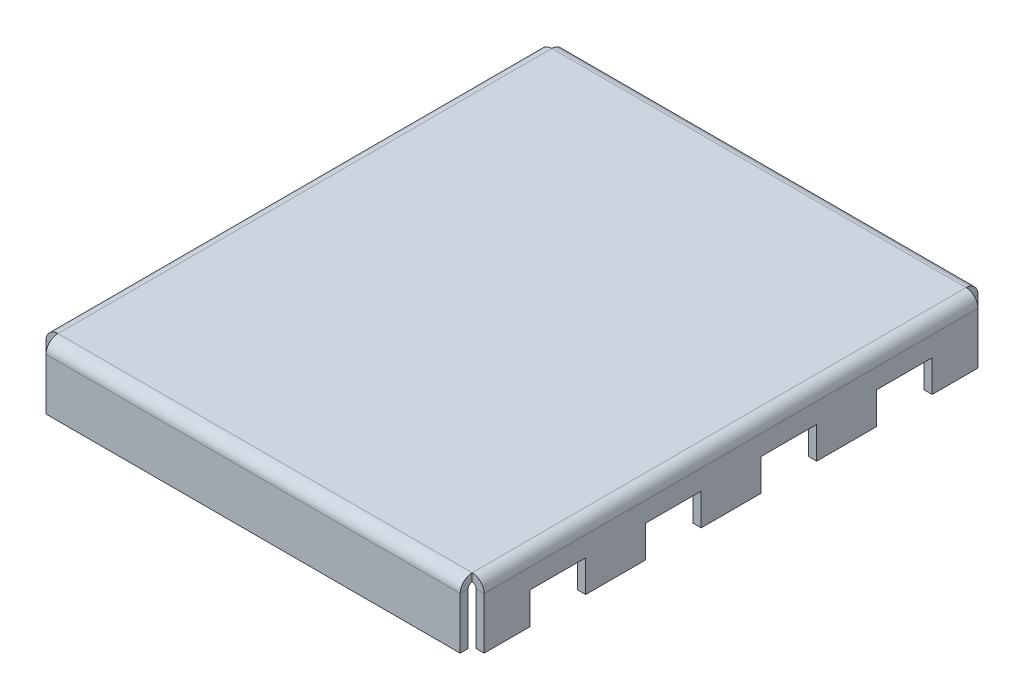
ISO-10303-21;
HEADER;
FILE_DESCRIPTION(('STEP AP214'),'2;1');
FILE_NAME('part.step','',(''),(''),'','','');
FILE_SCHEMA(('AUTOMOTIVE_DESIGN { 1 0 10303 214 1 1 1 1 }'));
ENDSEC;
DATA;
#1=APPLICATION_CONTEXT('core data for automotive mechanical design processes');
#2=APPLICATION_PROTOCOL_DEFINITION('international standard','automotive_design',2000,#1);
#3=PRODUCT_CONTEXT('',#1,'mechanical');
#4=PRODUCT('Part','Part','',(#3));
#5=PRODUCT_RELATED_PRODUCT_CATEGORY('part','',(#4));
#6=PRODUCT_DEFINITION_FORMATION('','',#4);
#7=PRODUCT_DEFINITION_CONTEXT('part definition',#1,'design');
#8=PRODUCT_DEFINITION('design','',#6,#7);
#9=PRODUCT_DEFINITION_SHAPE('','',#8);
#10=(LENGTH_UNIT() NAMED_UNIT(*) SI_UNIT(.MILLI.,.METRE.));
#11=(NAMED_UNIT(*) PLANE_ANGLE_UNIT() SI_UNIT($,.RADIAN.));
#12=(NAMED_UNIT(*) SI_UNIT($,.STERADIAN.) SOLID_ANGLE_UNIT());
#13=UNCERTAINTY_MEASURE_WITH_UNIT(LENGTH_MEASURE(1.E-05),#10,'distance_accuracy_value','');
#14=(GEOMETRIC_REPRESENTATION_CONTEXT(3) GLOBAL_UNCERTAINTY_ASSIGNED_CONTEXT((#13)) GLOBAL_UNIT_ASSIGNED_CONTEXT((#10,
#11,#12)) REPRESENTATION_CONTEXT('',''));
#15=CARTESIAN_POINT('',(0.,0.,0.));
#16=DIRECTION('',(0.,0.,1.));
#17=DIRECTION('',(1.,0.,0.));
#18=AXIS2_PLACEMENT_3D('',#15,#16,#17);
#19=CARTESIAN_POINT('',(5.5,0.,-6.2));
#20=DIRECTION('',(0.,1.,0.));
#21=DIRECTION('',(-1.,0.,0.));
#22=AXIS2_PLACEMENT_3D('',#19,#20,#21);
#23=PLANE('',#22);
#24=DIRECTION('',(0.,0.,1.));
#25=VECTOR('',#24,1.);
#26=CARTESIAN_POINT('',(5.3,0.,-6.2));
#27=LINE('',#26,#25);
#28=CARTESIAN_POINT('',(5.3,0.,0.749999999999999));
#29=VERTEX_POINT('',#28);
#30=CARTESIAN_POINT('',(5.3,0.,-0.750000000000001));
#31=VERTEX_POINT('',#30);
#32=EDGE_CURVE('E467',#29,#31,#27,.F.);
#33=ORIENTED_EDGE('',*,*,#32,.T.);
#34=DIRECTION('',(1.,0.,0.));
#35=VECTOR('',#34,1.);
#36=CARTESIAN_POINT('',(-5.50000000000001,0.,-0.750000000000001));
#37=LINE('',#36,#35);
#38=CARTESIAN_POINT('',(5.5,0.,-0.750000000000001));
#39=VERTEX_POINT('',#38);
#40=EDGE_CURVE('E450',#31,#39,#37,.T.);
#41=ORIENTED_EDGE('',*,*,#40,.T.);
#42=DIRECTION('',(0.,0.,-1.));
#43=VECTOR('',#42,1.);
#44=CARTESIAN_POINT('',(5.5,0.,0.));
#45=LINE('',#44,#43);
#46=CARTESIAN_POINT('',(5.5,0.,0.749999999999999));
#47=VERTEX_POINT('',#46);
#48=EDGE_CURVE('E465',#47,#39,#45,.T.);
#49=ORIENTED_EDGE('',*,*,#48,.F.);
#50=DIRECTION('',(1.,0.,0.));
#51=VECTOR('',#50,1.);
#52=CARTESIAN_POINT('',(-5.50000000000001,0.,0.749999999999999));
#53=LINE('',#52,#51);
#54=EDGE_CURVE('E1646',#29,#47,#53,.T.);
#55=ORIENTED_EDGE('',*,*,#54,.F.);
#56=EDGE_LOOP('',(#33,#41,#49,#55));
#57=FACE_BOUND('',#56,.T.);
#58=ADVANCED_FACE('F120',(#57),#23,.F.);
#59=CARTESIAN_POINT('',(5.3,0.,3.65));
#60=VERTEX_POINT('',#59);
#61=CARTESIAN_POINT('',(5.3,0.,2.15));
#62=VERTEX_POINT('',#61);
#63=EDGE_CURVE('E494',#60,#62,#27,.F.);
#64=ORIENTED_EDGE('',*,*,#63,.T.);
#65=DIRECTION('',(1.,0.,0.));
#66=VECTOR('',#65,1.);
#67=CARTESIAN_POINT('',(-5.50000000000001,0.,2.15));
#68=LINE('',#67,#66);
#69=CARTESIAN_POINT('',(5.5,0.,2.15));
#70=VERTEX_POINT('',#69);
#71=EDGE_CURVE('E1626',#62,#70,#68,.T.);
#72=ORIENTED_EDGE('',*,*,#71,.T.);
#73=CARTESIAN_POINT('',(5.5,0.,3.65));
#74=VERTEX_POINT('',#73);
#75=EDGE_CURVE('E475',#74,#70,#45,.T.);
#76=ORIENTED_EDGE('',*,*,#75,.F.);
#77=DIRECTION('',(1.,0.,0.));
#78=VECTOR('',#77,1.);
#79=CARTESIAN_POINT('',(-5.50000000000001,0.,3.65));
#80=LINE('',#79,#78);
#81=EDGE_CURVE('E891',#60,#74,#80,.T.);
#82=ORIENTED_EDGE('',*,*,#81,.F.);
#83=EDGE_LOOP('',(#64,#72,#76,#82));
#84=FACE_BOUND('',#83,.T.);
#85=ADVANCED_FACE('F810',(#84),#23,.F.);
#86=CARTESIAN_POINT('',(5.3,0.,6.2));
#87=VERTEX_POINT('',#86);
#88=CARTESIAN_POINT('',(5.3,0.,5.05));
#89=VERTEX_POINT('',#88);
#90=EDGE_CURVE('E491',#87,#89,#27,.F.);
#91=ORIENTED_EDGE('',*,*,#90,.T.);
#92=DIRECTION('',(1.,0.,0.));
#93=VECTOR('',#92,1.);
#94=CARTESIAN_POINT('',(-5.50000000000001,0.,5.05));
#95=LINE('',#94,#93);
#96=CARTESIAN_POINT('',(5.5,0.,5.05));
#97=VERTEX_POINT('',#96);
#98=EDGE_CURVE('E854',#89,#97,#95,.T.);
#99=ORIENTED_EDGE('',*,*,#98,.T.);
#100=CARTESIAN_POINT('',(5.5,0.,6.2));
#101=VERTEX_POINT('',#100);
#102=EDGE_CURVE('E479',#101,#97,#45,.T.);
#103=ORIENTED_EDGE('',*,*,#102,.F.);
#104=DIRECTION('',(-1.,0.,0.));
#105=VECTOR('',#104,1.);
#106=CARTESIAN_POINT('',(5.5,0.,6.2));
#107=LINE('',#106,#105);
#108=EDGE_CURVE('E523',#101,#87,#107,.T.);
#109=ORIENTED_EDGE('',*,*,#108,.T.);
#110=EDGE_LOOP('',(#91,#99,#103,#109));
#111=FACE_BOUND('',#110,.T.);
#112=ADVANCED_FACE('F816',(#111),#23,.F.);
#113=CARTESIAN_POINT('',(-5.5,0.,6.2));
#114=DIRECTION('',(0.,1.,0.));
#115=DIRECTION('',(-1.,0.,0.));
#116=AXIS2_PLACEMENT_3D('',#113,#114,#115);
#117=PLANE('',#116);
#118=DIRECTION('',(0.,0.,1.));
#119=VECTOR('',#118,1.);
#120=CARTESIAN_POINT('',(-5.50000000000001,0.,0.));
#121=LINE('',#120,#119);
#122=CARTESIAN_POINT('',(-5.50000000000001,0.,-0.750000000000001));
#123=VERTEX_POINT('',#122);
#124=CARTESIAN_POINT('',(-5.50000000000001,0.,0.749999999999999));
#125=VERTEX_POINT('',#124);
#126=EDGE_CURVE('E1013',#123,#125,#121,.T.);
#127=ORIENTED_EDGE('',*,*,#126,.F.);
#128=CARTESIAN_POINT('',(-5.30000000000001,0.,-0.750000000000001));
#129=VERTEX_POINT('',#128);
#130=EDGE_CURVE('E468',#123,#129,#37,.T.);
#131=ORIENTED_EDGE('',*,*,#130,.T.);
#132=DIRECTION('',(0.,0.,-1.));
#133=VECTOR('',#132,1.);
#134=CARTESIAN_POINT('',(-5.3,0.,6.2));
#135=LINE('',#134,#133);
#136=CARTESIAN_POINT('',(-5.30000000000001,0.,0.749999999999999));
#137=VERTEX_POINT('',#136);
#138=EDGE_CURVE('E682',#129,#137,#135,.F.);
#139=ORIENTED_EDGE('',*,*,#138,.T.);
#140=EDGE_CURVE('E1645',#125,#137,#53,.T.);
#141=ORIENTED_EDGE('',*,*,#140,.F.);
#142=EDGE_LOOP('',(#127,#131,#139,#141));
#143=FACE_BOUND('',#142,.T.);
#144=ADVANCED_FACE('F847',(#143),#117,.F.);
#145=CARTESIAN_POINT('',(-5.50000000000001,0.,2.15));
#146=VERTEX_POINT('',#145);
#147=CARTESIAN_POINT('',(-5.50000000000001,0.,3.65));
#148=VERTEX_POINT('',#147);
#149=EDGE_CURVE('E972',#146,#148,#121,.T.);
#150=ORIENTED_EDGE('',*,*,#149,.F.);
#151=CARTESIAN_POINT('',(-5.30000000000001,0.,2.15));
#152=VERTEX_POINT('',#151);
#153=EDGE_CURVE('E867',#146,#152,#68,.T.);
#154=ORIENTED_EDGE('',*,*,#153,.T.);
#155=CARTESIAN_POINT('',(-5.3,0.,3.65));
#156=VERTEX_POINT('',#155);
#157=EDGE_CURVE('E687',#152,#156,#135,.F.);
#158=ORIENTED_EDGE('',*,*,#157,.T.);
#159=EDGE_CURVE('E889',#148,#156,#80,.T.);
#160=ORIENTED_EDGE('',*,*,#159,.F.);
#161=EDGE_LOOP('',(#150,#154,#158,#160));
#162=FACE_BOUND('',#161,.T.);
#163=ADVANCED_FACE('F843',(#162),#117,.F.);
#164=CARTESIAN_POINT('',(-5.50000000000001,0.,5.05));
#165=VERTEX_POINT('',#164);
#166=CARTESIAN_POINT('',(-5.5,0.,6.2));
#167=VERTEX_POINT('',#166);
#168=EDGE_CURVE('E966',#165,#167,#121,.T.);
#169=ORIENTED_EDGE('',*,*,#168,.F.);
#170=CARTESIAN_POINT('',(-5.3,0.,5.05));
#171=VERTEX_POINT('',#170);
#172=EDGE_CURVE('E892',#165,#171,#95,.T.);
#173=ORIENTED_EDGE('',*,*,#172,.T.);
#174=CARTESIAN_POINT('',(-5.3,0.,6.2));
#175=VERTEX_POINT('',#174);
#176=EDGE_CURVE('E692',#171,#175,#135,.F.);
#177=ORIENTED_EDGE('',*,*,#176,.T.);
#178=DIRECTION('',(1.,0.,0.));
#179=VECTOR('',#178,1.);
#180=CARTESIAN_POINT('',(-5.5,0.,6.2));
#181=LINE('',#180,#179);
#182=EDGE_CURVE('E957',#167,#175,#181,.T.);
#183=ORIENTED_EDGE('',*,*,#182,.F.);
#184=EDGE_LOOP('',(#169,#173,#177,#183));
#185=FACE_BOUND('',#184,.T.);
#186=ADVANCED_FACE('F834',(#185),#117,.F.);
#187=CARTESIAN_POINT('',(5.5,0.,-2.15));
#188=VERTEX_POINT('',#187);
#189=CARTESIAN_POINT('',(5.5,0.,-3.65));
#190=VERTEX_POINT('',#189);
#191=EDGE_CURVE('E476',#188,#190,#45,.T.);
#192=ORIENTED_EDGE('',*,*,#191,.F.);
#193=DIRECTION('',(1.,0.,0.));
#194=VECTOR('',#193,1.);
#195=CARTESIAN_POINT('',(-5.50000000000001,0.,-2.15));
#196=LINE('',#195,#194);
#197=CARTESIAN_POINT('',(5.3,0.,-2.15));
#198=VERTEX_POINT('',#197);
#199=EDGE_CURVE('E1611',#198,#188,#196,.T.);
#200=ORIENTED_EDGE('',*,*,#199,.F.);
#201=CARTESIAN_POINT('',(5.3,0.,-3.65));
#202=VERTEX_POINT('',#201);
#203=EDGE_CURVE('E495',#198,#202,#27,.F.);
#204=ORIENTED_EDGE('',*,*,#203,.T.);
#205=DIRECTION('',(1.,0.,0.));
#206=VECTOR('',#205,1.);
#207=CARTESIAN_POINT('',(-5.50000000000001,0.,-3.65));
#208=LINE('',#207,#206);
#209=EDGE_CURVE('E931',#202,#190,#208,.T.);
#210=ORIENTED_EDGE('',*,*,#209,.T.);
#211=EDGE_LOOP('',(#192,#200,#204,#210));
#212=FACE_BOUND('',#211,.T.);
#213=ADVANCED_FACE('F823',(#212),#23,.F.);
#214=CARTESIAN_POINT('',(-5.3,0.,-3.65));
#215=VERTEX_POINT('',#214);
#216=CARTESIAN_POINT('',(-5.30000000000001,0.,-2.15));
#217=VERTEX_POINT('',#216);
#218=EDGE_CURVE('E686',#215,#217,#135,.F.);
#219=ORIENTED_EDGE('',*,*,#218,.T.);
#220=CARTESIAN_POINT('',(-5.50000000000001,0.,-2.15));
#221=VERTEX_POINT('',#220);
#222=EDGE_CURVE('E1012',#221,#217,#196,.T.);
#223=ORIENTED_EDGE('',*,*,#222,.F.);
#224=CARTESIAN_POINT('',(-5.50000000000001,0.,-3.65));
#225=VERTEX_POINT('',#224);
#226=EDGE_CURVE('E965',#225,#221,#121,.T.);
#227=ORIENTED_EDGE('',*,*,#226,.F.);
#228=EDGE_CURVE('E944',#225,#215,#208,.T.);
#229=ORIENTED_EDGE('',*,*,#228,.T.);
#230=EDGE_LOOP('',(#219,#223,#227,#229));
#231=FACE_BOUND('',#230,.T.);
#232=ADVANCED_FACE('F833',(#231),#117,.F.);
#233=CARTESIAN_POINT('',(0.,1.4,0.));
#234=DIRECTION('',(0.,1.,0.));
#235=DIRECTION('',(0.,0.,1.));
#236=AXIS2_PLACEMENT_3D('',#233,#234,#235);
#237=PLANE('',#236);
#238=DIRECTION('',(0.,0.,-1.));
#239=VECTOR('',#238,1.);
#240=CARTESIAN_POINT('',(5.2,1.4,-6.2));
#241=LINE('',#240,#239);
#242=CARTESIAN_POINT('',(5.2,1.4,6.2));
#243=VERTEX_POINT('',#242);
#244=CARTESIAN_POINT('',(5.2,1.4,-6.2));
#245=VERTEX_POINT('',#244);
#246=EDGE_CURVE('E612',#243,#245,#241,.T.);
#247=ORIENTED_EDGE('',*,*,#246,.F.);
#248=DIRECTION('',(1.,0.,0.));
#249=VECTOR('',#248,1.);
#250=CARTESIAN_POINT('',(-5.2,1.4,6.2));
#251=LINE('',#250,#249);
#252=CARTESIAN_POINT('',(-5.2,1.4,6.2));
#253=VERTEX_POINT('',#252);
#254=EDGE_CURVE('E614',#253,#243,#251,.T.);
#255=ORIENTED_EDGE('',*,*,#254,.F.);
#256=DIRECTION('',(0.,0.,1.));
#257=VECTOR('',#256,1.);
#258=CARTESIAN_POINT('',(-5.2,1.4,-6.2));
#259=LINE('',#258,#257);
#260=CARTESIAN_POINT('',(-5.2,1.4,-6.2));
#261=VERTEX_POINT('',#260);
#262=EDGE_CURVE('E618',#261,#253,#259,.T.);
#263=ORIENTED_EDGE('',*,*,#262,.F.);
#264=DIRECTION('',(-1.,0.,0.));
#265=VECTOR('',#264,1.);
#266=CARTESIAN_POINT('',(-5.2,1.4,-6.2));
#267=LINE('',#266,#265);
#268=EDGE_CURVE('E620',#245,#261,#267,.T.);
#269=ORIENTED_EDGE('',*,*,#268,.F.);
#270=EDGE_LOOP('',(#247,#255,#263,#269));
#271=FACE_BOUND('',#270,.T.);
#272=ADVANCED_FACE('F770',(#271),#237,.F.);
#273=CARTESIAN_POINT('',(0.,1.6,0.));
#274=DIRECTION('',(0.,1.,0.));
#275=DIRECTION('',(0.,0.,1.));
#276=AXIS2_PLACEMENT_3D('',#273,#274,#275);
#277=PLANE('',#276);
#278=DIRECTION('',(0.,0.,1.));
#279=VECTOR('',#278,1.);
#280=CARTESIAN_POINT('',(5.2,1.6,0.));
#281=LINE('',#280,#279);
#282=CARTESIAN_POINT('',(5.2,1.6,6.2));
#283=VERTEX_POINT('',#282);
#284=CARTESIAN_POINT('',(5.2,1.6,-6.2));
#285=VERTEX_POINT('',#284);
#286=EDGE_CURVE('E603',#283,#285,#281,.F.);
#287=ORIENTED_EDGE('',*,*,#286,.T.);
#288=DIRECTION('',(1.,0.,0.));
#289=VECTOR('',#288,1.);
#290=CARTESIAN_POINT('',(0.,1.6,-6.2));
#291=LINE('',#290,#289);
#292=CARTESIAN_POINT('',(-5.2,1.6,-6.2));
#293=VERTEX_POINT('',#292);
#294=EDGE_CURVE('E615',#285,#293,#291,.F.);
#295=ORIENTED_EDGE('',*,*,#294,.T.);
#296=DIRECTION('',(0.,0.,1.));
#297=VECTOR('',#296,1.);
#298=CARTESIAN_POINT('',(-5.2,1.6,0.));
#299=LINE('',#298,#297);
#300=CARTESIAN_POINT('',(-5.2,1.6,6.2));
#301=VERTEX_POINT('',#300);
#302=EDGE_CURVE('E629',#293,#301,#299,.T.);
#303=ORIENTED_EDGE('',*,*,#302,.T.);
#304=DIRECTION('',(1.,0.,0.));
#305=VECTOR('',#304,1.);
#306=CARTESIAN_POINT('',(0.,1.6,6.2));
#307=LINE('',#306,#305);
#308=EDGE_CURVE('E626',#301,#283,#307,.T.);
#309=ORIENTED_EDGE('',*,*,#308,.T.);
#310=EDGE_LOOP('',(#287,#295,#303,#309));
#311=FACE_BOUND('',#310,.T.);
#312=ADVANCED_FACE('F122',(#311),#277,.T.);
#313=CARTESIAN_POINT('',(5.2,1.3,6.2));
#314=DIRECTION('',(1.,0.,0.));
#315=DIRECTION('',(0.,0.,-1.));
#316=AXIS2_PLACEMENT_3D('',#313,#314,#315);
#317=PLANE('',#316);
#318=DIRECTION('',(0.,0.,-1.));
#319=VECTOR('',#318,1.);
#320=CARTESIAN_POINT('',(5.2,1.3,6.5));
#321=LINE('',#320,#319);
#322=CARTESIAN_POINT('',(5.2,1.3,6.3));
#323=VERTEX_POINT('',#322);
#324=CARTESIAN_POINT('',(5.2,1.3,6.5));
#325=VERTEX_POINT('',#324);
#326=EDGE_CURVE('E559',#323,#325,#321,.F.);
#327=ORIENTED_EDGE('',*,*,#326,.F.);
#328=CARTESIAN_POINT('',(5.2,1.3,6.2));
#329=DIRECTION('',(-1.,0.,0.));
#330=DIRECTION('',(0.,0.,1.));
#331=AXIS2_PLACEMENT_3D('',#328,#329,#330);
#332=CIRCLE('',#331,0.0999999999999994);
#333=EDGE_CURVE('E607',#243,#323,#332,.F.);
#334=ORIENTED_EDGE('',*,*,#333,.F.);
#335=DIRECTION('',(0.,-1.,0.));
#336=VECTOR('',#335,1.);
#337=CARTESIAN_POINT('',(5.2,1.4,6.2));
#338=LINE('',#337,#336);
#339=EDGE_CURVE('E623',#283,#243,#338,.T.);
#340=ORIENTED_EDGE('',*,*,#339,.F.);
#341=CARTESIAN_POINT('',(5.2,1.3,6.2));
#342=DIRECTION('',(-1.,0.,0.));
#343=DIRECTION('',(0.,0.,1.));
#344=AXIS2_PLACEMENT_3D('',#341,#342,#343);
#345=CIRCLE('',#344,0.299999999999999);
#346=EDGE_CURVE('E600',#283,#325,#345,.F.);
#347=ORIENTED_EDGE('',*,*,#346,.T.);
#348=EDGE_LOOP('',(#327,#334,#340,#347));
#349=FACE_BOUND('',#348,.T.);
#350=ADVANCED_FACE('F768',(#349),#317,.T.);
#351=CARTESIAN_POINT('',(-5.2,1.3,6.2));
#352=DIRECTION('',(1.,0.,0.));
#353=DIRECTION('',(0.,0.,-1.));
#354=AXIS2_PLACEMENT_3D('',#351,#352,#353);
#355=PLANE('',#354);
#356=CARTESIAN_POINT('',(-5.2,1.3,6.2));
#357=DIRECTION('',(-1.,0.,0.));
#358=DIRECTION('',(0.,0.,1.));
#359=AXIS2_PLACEMENT_3D('',#356,#357,#358);
#360=CIRCLE('',#359,0.0999999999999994);
#361=CARTESIAN_POINT('',(-5.2,1.3,6.3));
#362=VERTEX_POINT('',#361);
#363=EDGE_CURVE('E571',#362,#253,#360,.T.);
#364=ORIENTED_EDGE('',*,*,#363,.F.);
#365=DIRECTION('',(0.,0.,-1.));
#366=VECTOR('',#365,1.);
#367=CARTESIAN_POINT('',(-5.2,1.3,6.3));
#368=LINE('',#367,#366);
#369=CARTESIAN_POINT('',(-5.2,1.3,6.5));
#370=VERTEX_POINT('',#369);
#371=EDGE_CURVE('E593',#362,#370,#368,.F.);
#372=ORIENTED_EDGE('',*,*,#371,.T.);
#373=CARTESIAN_POINT('',(-5.2,1.3,6.2));
#374=DIRECTION('',(-1.,0.,0.));
#375=DIRECTION('',(0.,0.,1.));
#376=AXIS2_PLACEMENT_3D('',#373,#374,#375);
#377=CIRCLE('',#376,0.299999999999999);
#378=EDGE_CURVE('E604',#370,#301,#377,.T.);
#379=ORIENTED_EDGE('',*,*,#378,.T.);
#380=DIRECTION('',(0.,-1.,0.));
#381=VECTOR('',#380,1.);
#382=CARTESIAN_POINT('',(-5.2,1.4,6.2));
#383=LINE('',#382,#381);
#384=EDGE_CURVE('E639',#301,#253,#383,.T.);
#385=ORIENTED_EDGE('',*,*,#384,.T.);
#386=EDGE_LOOP('',(#364,#372,#379,#385));
#387=FACE_BOUND('',#386,.T.);
#388=ADVANCED_FACE('F1047',(#387),#355,.F.);
#389=CARTESIAN_POINT('',(-5.2,1.3,6.2));
#390=DIRECTION('',(-1.,0.,0.));
#391=DIRECTION('',(0.,0.,1.));
#392=AXIS2_PLACEMENT_3D('',#389,#390,#391);
#393=CYLINDRICAL_SURFACE('',#392,0.299999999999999);
#394=ORIENTED_EDGE('',*,*,#308,.F.);
#395=ORIENTED_EDGE('',*,*,#378,.F.);
#396=DIRECTION('',(-1.,0.,0.));
#397=VECTOR('',#396,1.);
#398=CARTESIAN_POINT('',(5.2,1.3,6.5));
#399=LINE('',#398,#397);
#400=EDGE_CURVE('E591',#370,#325,#399,.F.);
#401=ORIENTED_EDGE('',*,*,#400,.T.);
#402=ORIENTED_EDGE('',*,*,#346,.F.);
#403=EDGE_LOOP('',(#394,#395,#401,#402));
#404=FACE_BOUND('',#403,.T.);
#405=ADVANCED_FACE('F1045',(#404),#393,.T.);
#406=CARTESIAN_POINT('',(-5.2,1.3,6.2));
#407=DIRECTION('',(-1.,0.,0.));
#408=DIRECTION('',(0.,0.,1.));
#409=AXIS2_PLACEMENT_3D('',#406,#407,#408);
#410=CYLINDRICAL_SURFACE('',#409,0.0999999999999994);
#411=ORIENTED_EDGE('',*,*,#254,.T.);
#412=ORIENTED_EDGE('',*,*,#333,.T.);
#413=DIRECTION('',(-1.,0.,0.));
#414=VECTOR('',#413,1.);
#415=CARTESIAN_POINT('',(5.2,1.3,6.3));
#416=LINE('',#415,#414);
#417=EDGE_CURVE('E596',#323,#362,#416,.T.);
#418=ORIENTED_EDGE('',*,*,#417,.T.);
#419=ORIENTED_EDGE('',*,*,#363,.T.);
#420=EDGE_LOOP('',(#411,#412,#418,#419));
#421=FACE_BOUND('',#420,.T.);
#422=ADVANCED_FACE('F762',(#421),#410,.F.);
#423=CARTESIAN_POINT('',(5.2,1.4,6.5));
#424=DIRECTION('',(-1.,0.,0.));
#425=DIRECTION('',(0.,0.,1.));
#426=AXIS2_PLACEMENT_3D('',#423,#424,#425);
#427=PLANE('',#426);
#428=ORIENTED_EDGE('',*,*,#326,.T.);
#429=DIRECTION('',(0.,1.,0.));
#430=VECTOR('',#429,1.);
#431=CARTESIAN_POINT('',(5.2,0.,6.5));
#432=LINE('',#431,#430);
#433=CARTESIAN_POINT('',(5.2,0.,6.5));
#434=VERTEX_POINT('',#433);
#435=EDGE_CURVE('E577',#434,#325,#432,.T.);
#436=ORIENTED_EDGE('',*,*,#435,.F.);
#437=DIRECTION('',(0.,0.,-1.));
#438=VECTOR('',#437,1.);
#439=CARTESIAN_POINT('',(5.2,0.,6.5));
#440=LINE('',#439,#438);
#441=CARTESIAN_POINT('',(5.2,0.,6.3));
#442=VERTEX_POINT('',#441);
#443=EDGE_CURVE('E568',#434,#442,#440,.T.);
#444=ORIENTED_EDGE('',*,*,#443,.T.);
#445=DIRECTION('',(0.,-1.,0.));
#446=VECTOR('',#445,1.);
#447=CARTESIAN_POINT('',(5.2,1.4,6.3));
#448=LINE('',#447,#446);
#449=EDGE_CURVE('E585',#442,#323,#448,.F.);
#450=ORIENTED_EDGE('',*,*,#449,.T.);
#451=EDGE_LOOP('',(#428,#436,#444,#450));
#452=FACE_BOUND('',#451,.T.);
#453=ADVANCED_FACE('F1093',(#452),#427,.F.);
#454=CARTESIAN_POINT('',(-5.2,0.,6.5));
#455=DIRECTION('',(1.,0.,0.));
#456=DIRECTION('',(0.,0.,-1.));
#457=AXIS2_PLACEMENT_3D('',#454,#455,#456);
#458=PLANE('',#457);
#459=ORIENTED_EDGE('',*,*,#371,.F.);
#460=DIRECTION('',(0.,1.,0.));
#461=VECTOR('',#460,1.);
#462=CARTESIAN_POINT('',(-5.2,0.,6.3));
#463=LINE('',#462,#461);
#464=CARTESIAN_POINT('',(-5.2,0.,6.3));
#465=VERTEX_POINT('',#464);
#466=EDGE_CURVE('E583',#362,#465,#463,.F.);
#467=ORIENTED_EDGE('',*,*,#466,.T.);
#468=DIRECTION('',(0.,0.,-1.));
#469=VECTOR('',#468,1.);
#470=CARTESIAN_POINT('',(-5.2,0.,6.5));
#471=LINE('',#470,#469);
#472=CARTESIAN_POINT('',(-5.2,0.,6.5));
#473=VERTEX_POINT('',#472);
#474=EDGE_CURVE('E572',#473,#465,#471,.T.);
#475=ORIENTED_EDGE('',*,*,#474,.F.);
#476=DIRECTION('',(0.,-1.,0.));
#477=VECTOR('',#476,1.);
#478=CARTESIAN_POINT('',(-5.2,0.,6.5));
#479=LINE('',#478,#477);
#480=EDGE_CURVE('E575',#370,#473,#479,.T.);
#481=ORIENTED_EDGE('',*,*,#480,.F.);
#482=EDGE_LOOP('',(#459,#467,#475,#481));
#483=FACE_BOUND('',#482,.T.);
#484=ADVANCED_FACE('F1086',(#483),#458,.F.);
#485=CARTESIAN_POINT('',(0.,0.,6.5));
#486=DIRECTION('',(0.,0.,-1.));
#487=DIRECTION('',(0.,1.,0.));
#488=AXIS2_PLACEMENT_3D('',#485,#486,#487);
#489=PLANE('',#488);
#490=ORIENTED_EDGE('',*,*,#400,.F.);
#491=ORIENTED_EDGE('',*,*,#480,.T.);
#492=DIRECTION('',(1.,0.,0.));
#493=VECTOR('',#492,1.);
#494=CARTESIAN_POINT('',(0.,0.,6.5));
#495=LINE('',#494,#493);
#496=EDGE_CURVE('E580',#473,#434,#495,.T.);
#497=ORIENTED_EDGE('',*,*,#496,.T.);
#498=ORIENTED_EDGE('',*,*,#435,.T.);
#499=EDGE_LOOP('',(#490,#491,#497,#498));
#500=FACE_BOUND('',#499,.T.);
#501=ADVANCED_FACE('F1082',(#500),#489,.F.);
#502=CARTESIAN_POINT('',(0.,0.,6.3));
#503=DIRECTION('',(0.,0.,-1.));
#504=DIRECTION('',(0.,1.,0.));
#505=AXIS2_PLACEMENT_3D('',#502,#503,#504);
#506=PLANE('',#505);
#507=ORIENTED_EDGE('',*,*,#466,.F.);
#508=ORIENTED_EDGE('',*,*,#417,.F.);
#509=ORIENTED_EDGE('',*,*,#449,.F.);
#510=DIRECTION('',(-1.,0.,0.));
#511=VECTOR('',#510,1.);
#512=CARTESIAN_POINT('',(5.2,0.,6.3));
#513=LINE('',#512,#511);
#514=EDGE_CURVE('E588',#465,#442,#513,.F.);
#515=ORIENTED_EDGE('',*,*,#514,.F.);
#516=EDGE_LOOP('',(#507,#508,#509,#515));
#517=FACE_BOUND('',#516,.T.);
#518=ADVANCED_FACE('F1085',(#517),#506,.T.);
#519=CARTESIAN_POINT('',(5.2,0.,6.5));
#520=DIRECTION('',(0.,1.,0.));
#521=DIRECTION('',(0.,0.,1.));
#522=AXIS2_PLACEMENT_3D('',#519,#520,#521);
#523=PLANE('',#522);
#524=ORIENTED_EDGE('',*,*,#514,.T.);
#525=ORIENTED_EDGE('',*,*,#443,.F.);
#526=ORIENTED_EDGE('',*,*,#496,.F.);
#527=ORIENTED_EDGE('',*,*,#474,.T.);
#528=EDGE_LOOP('',(#524,#525,#526,#527));
#529=FACE_BOUND('',#528,.T.);
#530=ADVANCED_FACE('F1079',(#529),#523,.F.);
#531=CARTESIAN_POINT('',(-5.2,1.3,-6.2));
#532=DIRECTION('',(-1.,0.,0.));
#533=DIRECTION('',(0.,0.,1.));
#534=AXIS2_PLACEMENT_3D('',#531,#532,#533);
#535=PLANE('',#534);
#536=DIRECTION('',(0.,0.,1.));
#537=VECTOR('',#536,1.);
#538=CARTESIAN_POINT('',(-5.2,1.3,-6.5));
#539=LINE('',#538,#537);
#540=CARTESIAN_POINT('',(-5.2,1.3,-6.3));
#541=VERTEX_POINT('',#540);
#542=CARTESIAN_POINT('',(-5.2,1.3,-6.5));
#543=VERTEX_POINT('',#542);
#544=EDGE_CURVE('E513',#541,#543,#539,.F.);
#545=ORIENTED_EDGE('',*,*,#544,.F.);
#546=CARTESIAN_POINT('',(-5.2,1.3,-6.2));
#547=DIRECTION('',(1.,0.,0.));
#548=DIRECTION('',(0.,0.,-1.));
#549=AXIS2_PLACEMENT_3D('',#546,#547,#548);
#550=CIRCLE('',#549,0.0999999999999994);
#551=EDGE_CURVE('E563',#261,#541,#550,.F.);
#552=ORIENTED_EDGE('',*,*,#551,.F.);
#553=DIRECTION('',(0.,-1.,0.));
#554=VECTOR('',#553,1.);
#555=CARTESIAN_POINT('',(-5.2,1.4,-6.2));
#556=LINE('',#555,#554);
#557=EDGE_CURVE('E637',#293,#261,#556,.T.);
#558=ORIENTED_EDGE('',*,*,#557,.F.);
#559=CARTESIAN_POINT('',(-5.2,1.3,-6.2));
#560=DIRECTION('',(1.,0.,0.));
#561=DIRECTION('',(0.,0.,-1.));
#562=AXIS2_PLACEMENT_3D('',#559,#560,#561);
#563=CIRCLE('',#562,0.299999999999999);
#564=EDGE_CURVE('E556',#293,#543,#563,.F.);
#565=ORIENTED_EDGE('',*,*,#564,.T.);
#566=EDGE_LOOP('',(#545,#552,#558,#565));
#567=FACE_BOUND('',#566,.T.);
#568=ADVANCED_FACE('F778',(#567),#535,.T.);
#569=CARTESIAN_POINT('',(5.2,1.3,-6.2));
#570=DIRECTION('',(-1.,0.,0.));
#571=DIRECTION('',(0.,0.,1.));
#572=AXIS2_PLACEMENT_3D('',#569,#570,#571);
#573=PLANE('',#572);
#574=CARTESIAN_POINT('',(5.2,1.3,-6.2));
#575=DIRECTION('',(1.,0.,0.));
#576=DIRECTION('',(0.,0.,-1.));
#577=AXIS2_PLACEMENT_3D('',#574,#575,#576);
#578=CIRCLE('',#577,0.0999999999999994);
#579=CARTESIAN_POINT('',(5.2,1.3,-6.3));
#580=VERTEX_POINT('',#579);
#581=EDGE_CURVE('E527',#580,#245,#578,.T.);
#582=ORIENTED_EDGE('',*,*,#581,.F.);
#583=DIRECTION('',(0.,0.,1.));
#584=VECTOR('',#583,1.);
#585=CARTESIAN_POINT('',(5.2,1.3,-6.3));
#586=LINE('',#585,#584);
#587=CARTESIAN_POINT('',(5.2,1.3,-6.5));
#588=VERTEX_POINT('',#587);
#589=EDGE_CURVE('E549',#580,#588,#586,.F.);
#590=ORIENTED_EDGE('',*,*,#589,.T.);
#591=CARTESIAN_POINT('',(5.2,1.3,-6.2));
#592=DIRECTION('',(1.,0.,0.));
#593=DIRECTION('',(0.,0.,-1.));
#594=AXIS2_PLACEMENT_3D('',#591,#592,#593);
#595=CIRCLE('',#594,0.299999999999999);
#596=EDGE_CURVE('E560',#588,#285,#595,.T.);
#597=ORIENTED_EDGE('',*,*,#596,.T.);
#598=DIRECTION('',(0.,-1.,0.));
#599=VECTOR('',#598,1.);
#600=CARTESIAN_POINT('',(5.2,1.4,-6.2));
#601=LINE('',#600,#599);
#602=EDGE_CURVE('E634',#285,#245,#601,.T.);
#603=ORIENTED_EDGE('',*,*,#602,.T.);
#604=EDGE_LOOP('',(#582,#590,#597,#603));
#605=FACE_BOUND('',#604,.T.);
#606=ADVANCED_FACE('F797',(#605),#573,.F.);
#607=CARTESIAN_POINT('',(5.2,1.3,-6.2));
#608=DIRECTION('',(1.,0.,0.));
#609=DIRECTION('',(0.,0.,-1.));
#610=AXIS2_PLACEMENT_3D('',#607,#608,#609);
#611=CYLINDRICAL_SURFACE('',#610,0.299999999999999);
#612=ORIENTED_EDGE('',*,*,#294,.F.);
#613=ORIENTED_EDGE('',*,*,#596,.F.);
#614=DIRECTION('',(1.,0.,0.));
#615=VECTOR('',#614,1.);
#616=CARTESIAN_POINT('',(-5.2,1.3,-6.5));
#617=LINE('',#616,#615);
#618=EDGE_CURVE('E547',#588,#543,#617,.F.);
#619=ORIENTED_EDGE('',*,*,#618,.T.);
#620=ORIENTED_EDGE('',*,*,#564,.F.);
#621=EDGE_LOOP('',(#612,#613,#619,#620));
#622=FACE_BOUND('',#621,.T.);
#623=ADVANCED_FACE('F1052',(#622),#611,.T.);
#624=CARTESIAN_POINT('',(5.2,1.3,-6.2));
#625=DIRECTION('',(1.,0.,0.));
#626=DIRECTION('',(0.,0.,-1.));
#627=AXIS2_PLACEMENT_3D('',#624,#625,#626);
#628=CYLINDRICAL_SURFACE('',#627,0.0999999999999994);
#629=ORIENTED_EDGE('',*,*,#268,.T.);
#630=ORIENTED_EDGE('',*,*,#551,.T.);
#631=DIRECTION('',(1.,0.,0.));
#632=VECTOR('',#631,1.);
#633=CARTESIAN_POINT('',(-5.2,1.3,-6.3));
#634=LINE('',#633,#632);
#635=EDGE_CURVE('E552',#541,#580,#634,.T.);
#636=ORIENTED_EDGE('',*,*,#635,.T.);
#637=ORIENTED_EDGE('',*,*,#581,.T.);
#638=EDGE_LOOP('',(#629,#630,#636,#637));
#639=FACE_BOUND('',#638,.T.);
#640=ADVANCED_FACE('F773',(#639),#628,.F.);
#641=CARTESIAN_POINT('',(-5.2,1.4,-6.5));
#642=DIRECTION('',(1.,0.,0.));
#643=DIRECTION('',(0.,1.,0.));
#644=AXIS2_PLACEMENT_3D('',#641,#642,#643);
#645=PLANE('',#644);
#646=ORIENTED_EDGE('',*,*,#544,.T.);
#647=DIRECTION('',(0.,1.,0.));
#648=VECTOR('',#647,1.);
#649=CARTESIAN_POINT('',(-5.2,0.,-6.50000000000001));
#650=LINE('',#649,#648);
#651=CARTESIAN_POINT('',(-5.2,0.,-6.50000000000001));
#652=VERTEX_POINT('',#651);
#653=EDGE_CURVE('E533',#652,#543,#650,.T.);
#654=ORIENTED_EDGE('',*,*,#653,.F.);
#655=DIRECTION('',(0.,0.,1.));
#656=VECTOR('',#655,1.);
#657=CARTESIAN_POINT('',(-5.2,0.,-6.50000000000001));
#658=LINE('',#657,#656);
#659=CARTESIAN_POINT('',(-5.2,0.,-6.30000000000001));
#660=VERTEX_POINT('',#659);
#661=EDGE_CURVE('E524',#652,#660,#658,.T.);
#662=ORIENTED_EDGE('',*,*,#661,.T.);
#663=DIRECTION('',(0.,-1.,0.));
#664=VECTOR('',#663,1.);
#665=CARTESIAN_POINT('',(-5.2,1.4,-6.3));
#666=LINE('',#665,#664);
#667=EDGE_CURVE('E541',#660,#541,#666,.F.);
#668=ORIENTED_EDGE('',*,*,#667,.T.);
#669=EDGE_LOOP('',(#646,#654,#662,#668));
#670=FACE_BOUND('',#669,.T.);
#671=ADVANCED_FACE('F781',(#670),#645,.F.);
#672=CARTESIAN_POINT('',(5.2,0.,-6.50000000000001));
#673=DIRECTION('',(-1.,0.,0.));
#674=DIRECTION('',(0.,-1.,0.));
#675=AXIS2_PLACEMENT_3D('',#672,#673,#674);
#676=PLANE('',#675);
#677=ORIENTED_EDGE('',*,*,#589,.F.);
#678=DIRECTION('',(0.,1.,0.));
#679=VECTOR('',#678,1.);
#680=CARTESIAN_POINT('',(5.2,0.,-6.30000000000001));
#681=LINE('',#680,#679);
#682=CARTESIAN_POINT('',(5.2,0.,-6.30000000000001));
#683=VERTEX_POINT('',#682);
#684=EDGE_CURVE('E539',#580,#683,#681,.F.);
#685=ORIENTED_EDGE('',*,*,#684,.T.);
#686=DIRECTION('',(0.,0.,1.));
#687=VECTOR('',#686,1.);
#688=CARTESIAN_POINT('',(5.2,0.,-6.50000000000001));
#689=LINE('',#688,#687);
#690=CARTESIAN_POINT('',(5.2,0.,-6.50000000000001));
#691=VERTEX_POINT('',#690);
#692=EDGE_CURVE('E528',#691,#683,#689,.T.);
#693=ORIENTED_EDGE('',*,*,#692,.F.);
#694=DIRECTION('',(0.,-1.,0.));
#695=VECTOR('',#694,1.);
#696=CARTESIAN_POINT('',(5.2,0.,-6.50000000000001));
#697=LINE('',#696,#695);
#698=EDGE_CURVE('E531',#588,#691,#697,.T.);
#699=ORIENTED_EDGE('',*,*,#698,.F.);
#700=EDGE_LOOP('',(#677,#685,#693,#699));
#701=FACE_BOUND('',#700,.T.);
#702=ADVANCED_FACE('F799',(#701),#676,.F.);
#703=CARTESIAN_POINT('',(0.,0.,-6.50000000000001));
#704=DIRECTION('',(0.,0.,1.));
#705=DIRECTION('',(0.,-1.,0.));
#706=AXIS2_PLACEMENT_3D('',#703,#704,#705);
#707=PLANE('',#706);
#708=ORIENTED_EDGE('',*,*,#618,.F.);
#709=ORIENTED_EDGE('',*,*,#698,.T.);
#710=DIRECTION('',(-1.,0.,0.));
#711=VECTOR('',#710,1.);
#712=CARTESIAN_POINT('',(0.,0.,-6.50000000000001));
#713=LINE('',#712,#711);
#714=EDGE_CURVE('E536',#691,#652,#713,.T.);
#715=ORIENTED_EDGE('',*,*,#714,.T.);
#716=ORIENTED_EDGE('',*,*,#653,.T.);
#717=EDGE_LOOP('',(#708,#709,#715,#716));
#718=FACE_BOUND('',#717,.T.);
#719=ADVANCED_FACE('F784',(#718),#707,.F.);
#720=CARTESIAN_POINT('',(0.,0.,-6.30000000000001));
#721=DIRECTION('',(0.,0.,1.));
#722=DIRECTION('',(0.,-1.,0.));
#723=AXIS2_PLACEMENT_3D('',#720,#721,#722);
#724=PLANE('',#723);
#725=ORIENTED_EDGE('',*,*,#684,.F.);
#726=ORIENTED_EDGE('',*,*,#635,.F.);
#727=ORIENTED_EDGE('',*,*,#667,.F.);
#728=DIRECTION('',(1.,0.,0.));
#729=VECTOR('',#728,1.);
#730=CARTESIAN_POINT('',(-5.2,0.,-6.30000000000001));
#731=LINE('',#730,#729);
#732=EDGE_CURVE('E544',#683,#660,#731,.F.);
#733=ORIENTED_EDGE('',*,*,#732,.F.);
#734=EDGE_LOOP('',(#725,#726,#727,#733));
#735=FACE_BOUND('',#734,.T.);
#736=ADVANCED_FACE('F794',(#735),#724,.T.);
#737=CARTESIAN_POINT('',(-5.2,0.,-6.50000000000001));
#738=DIRECTION('',(0.,1.,0.));
#739=DIRECTION('',(0.,0.,1.));
#740=AXIS2_PLACEMENT_3D('',#737,#738,#739);
#741=PLANE('',#740);
#742=ORIENTED_EDGE('',*,*,#732,.T.);
#743=ORIENTED_EDGE('',*,*,#661,.F.);
#744=ORIENTED_EDGE('',*,*,#714,.F.);
#745=ORIENTED_EDGE('',*,*,#692,.T.);
#746=EDGE_LOOP('',(#742,#743,#744,#745));
#747=FACE_BOUND('',#746,.T.);
#748=ADVANCED_FACE('F790',(#747),#741,.F.);
#749=CARTESIAN_POINT('',(5.2,1.3,-6.2));
#750=DIRECTION('',(0.,0.,-1.));
#751=DIRECTION('',(-1.,0.,0.));
#752=AXIS2_PLACEMENT_3D('',#749,#750,#751);
#753=PLANE('',#752);
#754=DIRECTION('',(-1.,0.,0.));
#755=VECTOR('',#754,1.);
#756=CARTESIAN_POINT('',(5.5,1.3,-6.2));
#757=LINE('',#756,#755);
#758=CARTESIAN_POINT('',(5.3,1.3,-6.2));
#759=VERTEX_POINT('',#758);
#760=CARTESIAN_POINT('',(5.5,1.3,-6.2));
#761=VERTEX_POINT('',#760);
#762=EDGE_CURVE('E506',#759,#761,#757,.F.);
#763=ORIENTED_EDGE('',*,*,#762,.F.);
#764=CARTESIAN_POINT('',(5.2,1.3,-6.2));
#765=DIRECTION('',(0.,0.,1.));
#766=DIRECTION('',(1.,0.,0.));
#767=AXIS2_PLACEMENT_3D('',#764,#765,#766);
#768=CIRCLE('',#767,0.0999999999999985);
#769=EDGE_CURVE('E517',#245,#759,#768,.F.);
#770=ORIENTED_EDGE('',*,*,#769,.F.);
#771=ORIENTED_EDGE('',*,*,#602,.F.);
#772=CARTESIAN_POINT('',(5.2,1.3,-6.2));
#773=DIRECTION('',(0.,0.,1.));
#774=DIRECTION('',(1.,0.,0.));
#775=AXIS2_PLACEMENT_3D('',#772,#773,#774);
#776=CIRCLE('',#775,0.299999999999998);
#777=EDGE_CURVE('E510',#285,#761,#776,.F.);
#778=ORIENTED_EDGE('',*,*,#777,.T.);
#779=EDGE_LOOP('',(#763,#770,#771,#778));
#780=FACE_BOUND('',#779,.T.);
#781=ADVANCED_FACE('F738',(#780),#753,.T.);
#782=CARTESIAN_POINT('',(5.2,1.3,6.2));
#783=DIRECTION('',(0.,0.,-1.));
#784=DIRECTION('',(-1.,0.,0.));
#785=AXIS2_PLACEMENT_3D('',#782,#783,#784);
#786=PLANE('',#785);
#787=CARTESIAN_POINT('',(5.2,1.3,6.2));
#788=DIRECTION('',(0.,0.,1.));
#789=DIRECTION('',(1.,0.,0.));
#790=AXIS2_PLACEMENT_3D('',#787,#788,#789);
#791=CIRCLE('',#790,0.0999999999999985);
#792=CARTESIAN_POINT('',(5.3,1.3,6.2));
#793=VERTEX_POINT('',#792);
#794=EDGE_CURVE('E520',#793,#243,#791,.T.);
#795=ORIENTED_EDGE('',*,*,#794,.F.);
#796=DIRECTION('',(-1.,0.,0.));
#797=VECTOR('',#796,1.);
#798=CARTESIAN_POINT('',(5.3,1.3,6.2));
#799=LINE('',#798,#797);
#800=CARTESIAN_POINT('',(5.5,1.3,6.2));
#801=VERTEX_POINT('',#800);
#802=EDGE_CURVE('E501',#793,#801,#799,.F.);
#803=ORIENTED_EDGE('',*,*,#802,.T.);
#804=CARTESIAN_POINT('',(5.2,1.3,6.2));
#805=DIRECTION('',(0.,0.,1.));
#806=DIRECTION('',(1.,0.,0.));
#807=AXIS2_PLACEMENT_3D('',#804,#805,#806);
#808=CIRCLE('',#807,0.299999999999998);
#809=EDGE_CURVE('E514',#801,#283,#808,.T.);
#810=ORIENTED_EDGE('',*,*,#809,.T.);
#811=ORIENTED_EDGE('',*,*,#339,.T.);
#812=EDGE_LOOP('',(#795,#803,#810,#811));
#813=FACE_BOUND('',#812,.T.);
#814=ADVANCED_FACE('F756',(#813),#786,.F.);
#815=CARTESIAN_POINT('',(5.2,1.3,6.2));
#816=DIRECTION('',(0.,0.,1.));
#817=DIRECTION('',(1.,0.,0.));
#818=AXIS2_PLACEMENT_3D('',#815,#816,#817);
#819=CYLINDRICAL_SURFACE('',#818,0.299999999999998);
#820=ORIENTED_EDGE('',*,*,#286,.F.);
#821=ORIENTED_EDGE('',*,*,#809,.F.);
#822=DIRECTION('',(0.,0.,1.));
#823=VECTOR('',#822,1.);
#824=CARTESIAN_POINT('',(5.5,1.3,-6.2));
#825=LINE('',#824,#823);
#826=EDGE_CURVE('E499',#801,#761,#825,.F.);
#827=ORIENTED_EDGE('',*,*,#826,.T.);
#828=ORIENTED_EDGE('',*,*,#777,.F.);
#829=EDGE_LOOP('',(#820,#821,#827,#828));
#830=FACE_BOUND('',#829,.T.);
#831=ADVANCED_FACE('F1054',(#830),#819,.T.);
#832=CARTESIAN_POINT('',(5.2,1.3,6.2));
#833=DIRECTION('',(0.,0.,1.));
#834=DIRECTION('',(1.,0.,0.));
#835=AXIS2_PLACEMENT_3D('',#832,#833,#834);
#836=CYLINDRICAL_SURFACE('',#835,0.0999999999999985);
#837=ORIENTED_EDGE('',*,*,#246,.T.);
#838=ORIENTED_EDGE('',*,*,#769,.T.);
#839=DIRECTION('',(0.,0.,1.));
#840=VECTOR('',#839,1.);
#841=CARTESIAN_POINT('',(5.3,1.3,-6.2));
#842=LINE('',#841,#840);
#843=EDGE_CURVE('E504',#759,#793,#842,.T.);
#844=ORIENTED_EDGE('',*,*,#843,.T.);
#845=ORIENTED_EDGE('',*,*,#794,.T.);
#846=EDGE_LOOP('',(#837,#838,#844,#845));
#847=FACE_BOUND('',#846,.T.);
#848=ADVANCED_FACE('F742',(#847),#836,.F.);
#849=CARTESIAN_POINT('',(5.5,0.,6.2));
#850=DIRECTION('',(0.,0.,-1.));
#851=DIRECTION('',(-1.,0.,0.));
#852=AXIS2_PLACEMENT_3D('',#849,#850,#851);
#853=PLANE('',#852);
#854=ORIENTED_EDGE('',*,*,#802,.F.);
#855=DIRECTION('',(0.,1.,0.));
#856=VECTOR('',#855,1.);
#857=CARTESIAN_POINT('',(5.3,0.,6.2));
#858=LINE('',#857,#856);
#859=EDGE_CURVE('E497',#793,#87,#858,.F.);
#860=ORIENTED_EDGE('',*,*,#859,.T.);
#861=ORIENTED_EDGE('',*,*,#108,.F.);
#862=DIRECTION('',(0.,-1.,0.));
#863=VECTOR('',#862,1.);
#864=CARTESIAN_POINT('',(5.5,0.,6.2));
#865=LINE('',#864,#863);
#866=EDGE_CURVE('E486',#801,#101,#865,.T.);
#867=ORIENTED_EDGE('',*,*,#866,.F.);
#868=EDGE_LOOP('',(#854,#860,#861,#867));
#869=FACE_BOUND('',#868,.T.);
#870=ADVANCED_FACE('F754',(#869),#853,.F.);
#871=CARTESIAN_POINT('',(5.5,1.4,-6.2));
#872=DIRECTION('',(0.,0.,1.));
#873=DIRECTION('',(1.,0.,0.));
#874=AXIS2_PLACEMENT_3D('',#871,#872,#873);
#875=PLANE('',#874);
#876=ORIENTED_EDGE('',*,*,#762,.T.);
#877=DIRECTION('',(0.,1.,0.));
#878=VECTOR('',#877,1.);
#879=CARTESIAN_POINT('',(5.5,0.,-6.2));
#880=LINE('',#879,#878);
#881=CARTESIAN_POINT('',(5.5,0.,-6.2));
#882=VERTEX_POINT('',#881);
#883=EDGE_CURVE('E484',#882,#761,#880,.T.);
#884=ORIENTED_EDGE('',*,*,#883,.F.);
#885=DIRECTION('',(-1.,0.,0.));
#886=VECTOR('',#885,1.);
#887=CARTESIAN_POINT('',(5.5,0.,-6.2));
#888=LINE('',#887,#886);
#889=CARTESIAN_POINT('',(5.3,0.,-6.2));
#890=VERTEX_POINT('',#889);
#891=EDGE_CURVE('E724',#882,#890,#888,.T.);
#892=ORIENTED_EDGE('',*,*,#891,.T.);
#893=DIRECTION('',(0.,-1.,0.));
#894=VECTOR('',#893,1.);
#895=CARTESIAN_POINT('',(5.3,1.4,-6.2));
#896=LINE('',#895,#894);
#897=EDGE_CURVE('E488',#890,#759,#896,.F.);
#898=ORIENTED_EDGE('',*,*,#897,.T.);
#899=EDGE_LOOP('',(#876,#884,#892,#898));
#900=FACE_BOUND('',#899,.T.);
#901=ADVANCED_FACE('F735',(#900),#875,.F.);
#902=CARTESIAN_POINT('',(5.5,0.,0.));
#903=DIRECTION('',(-1.,0.,0.));
#904=DIRECTION('',(0.,-1.,0.));
#905=AXIS2_PLACEMENT_3D('',#902,#903,#904);
#906=PLANE('',#905);
#907=ORIENTED_EDGE('',*,*,#48,.T.);
#908=DIRECTION('',(0.,-1.,0.));
#909=VECTOR('',#908,1.);
#910=CARTESIAN_POINT('',(5.5,0.,-0.750000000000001));
#911=LINE('',#910,#909);
#912=CARTESIAN_POINT('',(5.5,0.799999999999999,-0.750000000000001));
#913=VERTEX_POINT('',#912);
#914=EDGE_CURVE('E447',#913,#39,#911,.T.);
#915=ORIENTED_EDGE('',*,*,#914,.F.);
#916=DIRECTION('',(0.,0.,1.));
#917=VECTOR('',#916,1.);
#918=CARTESIAN_POINT('',(5.5,0.799999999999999,-0.750000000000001));
#919=LINE('',#918,#917);
#920=CARTESIAN_POINT('',(5.5,0.799999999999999,-2.15));
#921=VERTEX_POINT('',#920);
#922=EDGE_CURVE('E1659',#921,#913,#919,.T.);
#923=ORIENTED_EDGE('',*,*,#922,.F.);
#924=DIRECTION('',(0.,1.,0.));
#925=VECTOR('',#924,1.);
#926=CARTESIAN_POINT('',(5.5,0.,-2.15));
#927=LINE('',#926,#925);
#928=EDGE_CURVE('E458',#188,#921,#927,.T.);
#929=ORIENTED_EDGE('',*,*,#928,.F.);
#930=ORIENTED_EDGE('',*,*,#191,.T.);
#931=DIRECTION('',(0.,-1.,0.));
#932=VECTOR('',#931,1.);
#933=CARTESIAN_POINT('',(5.5,0.,-3.65));
#934=LINE('',#933,#932);
#935=CARTESIAN_POINT('',(5.5,0.799999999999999,-3.65));
#936=VERTEX_POINT('',#935);
#937=EDGE_CURVE('E913',#936,#190,#934,.T.);
#938=ORIENTED_EDGE('',*,*,#937,.F.);
#939=DIRECTION('',(0.,0.,1.));
#940=VECTOR('',#939,1.);
#941=CARTESIAN_POINT('',(5.5,0.799999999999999,-3.65));
#942=LINE('',#941,#940);
#943=CARTESIAN_POINT('',(5.5,0.799999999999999,-5.05));
#944=VERTEX_POINT('',#943);
#945=EDGE_CURVE('E919',#944,#936,#942,.T.);
#946=ORIENTED_EDGE('',*,*,#945,.F.);
#947=DIRECTION('',(0.,1.,0.));
#948=VECTOR('',#947,1.);
#949=CARTESIAN_POINT('',(5.5,0.,-5.05));
#950=LINE('',#949,#948);
#951=CARTESIAN_POINT('',(5.5,0.,-5.05));
#952=VERTEX_POINT('',#951);
#953=EDGE_CURVE('E916',#952,#944,#950,.T.);
#954=ORIENTED_EDGE('',*,*,#953,.F.);
#955=EDGE_CURVE('E480',#952,#882,#45,.T.);
#956=ORIENTED_EDGE('',*,*,#955,.T.);
#957=ORIENTED_EDGE('',*,*,#883,.T.);
#958=ORIENTED_EDGE('',*,*,#826,.F.);
#959=ORIENTED_EDGE('',*,*,#866,.T.);
#960=ORIENTED_EDGE('',*,*,#102,.T.);
#961=DIRECTION('',(0.,-1.,0.));
#962=VECTOR('',#961,1.);
#963=CARTESIAN_POINT('',(5.5,0.,5.05));
#964=LINE('',#963,#962);
#965=CARTESIAN_POINT('',(5.5,0.799999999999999,5.05));
#966=VERTEX_POINT('',#965);
#967=EDGE_CURVE('E857',#966,#97,#964,.T.);
#968=ORIENTED_EDGE('',*,*,#967,.F.);
#969=DIRECTION('',(0.,0.,1.));
#970=VECTOR('',#969,1.);
#971=CARTESIAN_POINT('',(5.5,0.799999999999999,5.05));
#972=LINE('',#971,#970);
#973=CARTESIAN_POINT('',(5.5,0.799999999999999,3.65));
#974=VERTEX_POINT('',#973);
#975=EDGE_CURVE('E860',#974,#966,#972,.T.);
#976=ORIENTED_EDGE('',*,*,#975,.F.);
#977=DIRECTION('',(0.,1.,0.));
#978=VECTOR('',#977,1.);
#979=CARTESIAN_POINT('',(5.5,0.,3.65));
#980=LINE('',#979,#978);
#981=EDGE_CURVE('E862',#74,#974,#980,.T.);
#982=ORIENTED_EDGE('',*,*,#981,.F.);
#983=ORIENTED_EDGE('',*,*,#75,.T.);
#984=DIRECTION('',(0.,-1.,0.));
#985=VECTOR('',#984,1.);
#986=CARTESIAN_POINT('',(5.5,0.,2.15));
#987=LINE('',#986,#985);
#988=CARTESIAN_POINT('',(5.5,0.799999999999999,2.15));
#989=VERTEX_POINT('',#988);
#990=EDGE_CURVE('E883',#989,#70,#987,.T.);
#991=ORIENTED_EDGE('',*,*,#990,.F.);
#992=DIRECTION('',(0.,0.,1.));
#993=VECTOR('',#992,1.);
#994=CARTESIAN_POINT('',(5.5,0.799999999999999,2.15));
#995=LINE('',#994,#993);
#996=CARTESIAN_POINT('',(5.5,0.799999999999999,0.749999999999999));
#997=VERTEX_POINT('',#996);
#998=EDGE_CURVE('E1635',#997,#989,#995,.T.);
#999=ORIENTED_EDGE('',*,*,#998,.F.);
#1000=DIRECTION('',(0.,1.,0.));
#1001=VECTOR('',#1000,1.);
#1002=CARTESIAN_POINT('',(5.5,0.,0.749999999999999));
#1003=LINE('',#1002,#1001);
#1004=EDGE_CURVE('E474',#47,#997,#1003,.T.);
#1005=ORIENTED_EDGE('',*,*,#1004,.F.);
#1006=EDGE_LOOP('',(#907,#915,#923,#929,#930,#938,#946,#954,#956,#957,#958,#959,#960,#968,#976,
#982,#983,#991,#999,#1005));
#1007=FACE_BOUND('',#1006,.T.);
#1008=ADVANCED_FACE('F472',(#1007),#906,.F.);
#1009=CARTESIAN_POINT('',(5.3,0.,0.));
#1010=DIRECTION('',(-1.,0.,0.));
#1011=DIRECTION('',(0.,-1.,0.));
#1012=AXIS2_PLACEMENT_3D('',#1009,#1010,#1011);
#1013=PLANE('',#1012);
#1014=DIRECTION('',(0.,1.,0.));
#1015=VECTOR('',#1014,1.);
#1016=CARTESIAN_POINT('',(5.3,0.,-0.750000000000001));
#1017=LINE('',#1016,#1015);
#1018=CARTESIAN_POINT('',(5.3,0.799999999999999,-0.750000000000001));
#1019=VERTEX_POINT('',#1018);
#1020=EDGE_CURVE('E911',#31,#1019,#1017,.T.);
#1021=ORIENTED_EDGE('',*,*,#1020,.F.);
#1022=ORIENTED_EDGE('',*,*,#32,.F.);
#1023=DIRECTION('',(0.,-1.,0.));
#1024=VECTOR('',#1023,1.);
#1025=CARTESIAN_POINT('',(5.3,0.,0.749999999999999));
#1026=LINE('',#1025,#1024);
#1027=CARTESIAN_POINT('',(5.3,0.799999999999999,0.749999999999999));
#1028=VERTEX_POINT('',#1027);
#1029=EDGE_CURVE('E901',#1028,#29,#1026,.T.);
#1030=ORIENTED_EDGE('',*,*,#1029,.F.);
#1031=DIRECTION('',(0.,0.,-1.));
#1032=VECTOR('',#1031,1.);
#1033=CARTESIAN_POINT('',(5.3,0.799999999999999,0.));
#1034=LINE('',#1033,#1032);
#1035=CARTESIAN_POINT('',(5.3,0.799999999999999,2.15));
#1036=VERTEX_POINT('',#1035);
#1037=EDGE_CURVE('E903',#1036,#1028,#1034,.T.);
#1038=ORIENTED_EDGE('',*,*,#1037,.F.);
#1039=DIRECTION('',(0.,1.,0.));
#1040=VECTOR('',#1039,1.);
#1041=CARTESIAN_POINT('',(5.3,0.,2.15));
#1042=LINE('',#1041,#1040);
#1043=EDGE_CURVE('E905',#62,#1036,#1042,.T.);
#1044=ORIENTED_EDGE('',*,*,#1043,.F.);
#1045=ORIENTED_EDGE('',*,*,#63,.F.);
#1046=DIRECTION('',(0.,-1.,0.));
#1047=VECTOR('',#1046,1.);
#1048=CARTESIAN_POINT('',(5.3,0.,3.65));
#1049=LINE('',#1048,#1047);
#1050=CARTESIAN_POINT('',(5.3,0.799999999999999,3.65));
#1051=VERTEX_POINT('',#1050);
#1052=EDGE_CURVE('E676',#1051,#60,#1049,.T.);
#1053=ORIENTED_EDGE('',*,*,#1052,.F.);
#1054=DIRECTION('',(0.,0.,-1.));
#1055=VECTOR('',#1054,1.);
#1056=CARTESIAN_POINT('',(5.3,0.799999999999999,0.));
#1057=LINE('',#1056,#1055);
#1058=CARTESIAN_POINT('',(5.3,0.799999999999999,5.05));
#1059=VERTEX_POINT('',#1058);
#1060=EDGE_CURVE('E896',#1059,#1051,#1057,.T.);
#1061=ORIENTED_EDGE('',*,*,#1060,.F.);
#1062=DIRECTION('',(0.,1.,0.));
#1063=VECTOR('',#1062,1.);
#1064=CARTESIAN_POINT('',(5.3,0.,5.05));
#1065=LINE('',#1064,#1063);
#1066=EDGE_CURVE('E899',#89,#1059,#1065,.T.);
#1067=ORIENTED_EDGE('',*,*,#1066,.F.);
#1068=ORIENTED_EDGE('',*,*,#90,.F.);
#1069=ORIENTED_EDGE('',*,*,#859,.F.);
#1070=ORIENTED_EDGE('',*,*,#843,.F.);
#1071=ORIENTED_EDGE('',*,*,#897,.F.);
#1072=CARTESIAN_POINT('',(5.3,0.,-5.05));
#1073=VERTEX_POINT('',#1072);
#1074=EDGE_CURVE('E496',#1073,#890,#27,.F.);
#1075=ORIENTED_EDGE('',*,*,#1074,.F.);
#1076=DIRECTION('',(0.,-1.,0.));
#1077=VECTOR('',#1076,1.);
#1078=CARTESIAN_POINT('',(5.3,0.,-5.05));
#1079=LINE('',#1078,#1077);
#1080=CARTESIAN_POINT('',(5.3,0.799999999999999,-5.05));
#1081=VERTEX_POINT('',#1080);
#1082=EDGE_CURVE('E948',#1081,#1073,#1079,.T.);
#1083=ORIENTED_EDGE('',*,*,#1082,.F.);
#1084=DIRECTION('',(0.,0.,-1.));
#1085=VECTOR('',#1084,1.);
#1086=CARTESIAN_POINT('',(5.3,0.799999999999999,0.));
#1087=LINE('',#1086,#1085);
#1088=CARTESIAN_POINT('',(5.3,0.799999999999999,-3.65));
#1089=VERTEX_POINT('',#1088);
#1090=EDGE_CURVE('E710',#1089,#1081,#1087,.T.);
#1091=ORIENTED_EDGE('',*,*,#1090,.F.);
#1092=DIRECTION('',(0.,1.,0.));
#1093=VECTOR('',#1092,1.);
#1094=CARTESIAN_POINT('',(5.3,0.,-3.65));
#1095=LINE('',#1094,#1093);
#1096=EDGE_CURVE('E952',#202,#1089,#1095,.T.);
#1097=ORIENTED_EDGE('',*,*,#1096,.F.);
#1098=ORIENTED_EDGE('',*,*,#203,.F.);
#1099=DIRECTION('',(0.,-1.,0.));
#1100=VECTOR('',#1099,1.);
#1101=CARTESIAN_POINT('',(5.3,0.,-2.15));
#1102=LINE('',#1101,#1100);
#1103=CARTESIAN_POINT('',(5.3,0.799999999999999,-2.15));
#1104=VERTEX_POINT('',#1103);
#1105=EDGE_CURVE('E907',#1104,#198,#1102,.T.);
#1106=ORIENTED_EDGE('',*,*,#1105,.F.);
#1107=DIRECTION('',(0.,0.,-1.));
#1108=VECTOR('',#1107,1.);
#1109=CARTESIAN_POINT('',(5.3,0.799999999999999,0.));
#1110=LINE('',#1109,#1108);
#1111=EDGE_CURVE('E909',#1019,#1104,#1110,.T.);
#1112=ORIENTED_EDGE('',*,*,#1111,.F.);
#1113=EDGE_LOOP('',(#1021,#1022,#1030,#1038,#1044,#1045,#1053,#1061,#1067,#1068,#1069,#1070,
#1071,#1075,#1083,#1091,#1097,#1098,#1106,#1112));
#1114=FACE_BOUND('',#1113,.T.);
#1115=ADVANCED_FACE('F747',(#1114),#1013,.T.);
#1116=ORIENTED_EDGE('',*,*,#955,.F.);
#1117=DIRECTION('',(1.,0.,0.));
#1118=VECTOR('',#1117,1.);
#1119=CARTESIAN_POINT('',(-5.50000000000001,0.,-5.05));
#1120=LINE('',#1119,#1118);
#1121=EDGE_CURVE('E943',#1073,#952,#1120,.T.);
#1122=ORIENTED_EDGE('',*,*,#1121,.F.);
#1123=ORIENTED_EDGE('',*,*,#1074,.T.);
#1124=ORIENTED_EDGE('',*,*,#891,.F.);
#1125=EDGE_LOOP('',(#1116,#1122,#1123,#1124));
#1126=FACE_BOUND('',#1125,.T.);
#1127=ADVANCED_FACE('F812',(#1126),#23,.F.);
#1128=CARTESIAN_POINT('',(-5.2,1.3,6.2));
#1129=DIRECTION('',(0.,0.,1.));
#1130=DIRECTION('',(1.,0.,0.));
#1131=AXIS2_PLACEMENT_3D('',#1128,#1129,#1130);
#1132=PLANE('',#1131);
#1133=DIRECTION('',(1.,0.,0.));
#1134=VECTOR('',#1133,1.);
#1135=CARTESIAN_POINT('',(-5.5,1.3,6.2));
#1136=LINE('',#1135,#1134);
#1137=CARTESIAN_POINT('',(-5.3,1.3,6.2));
#1138=VERTEX_POINT('',#1137);
#1139=CARTESIAN_POINT('',(-5.5,1.3,6.2));
#1140=VERTEX_POINT('',#1139);
#1141=EDGE_CURVE('E707',#1138,#1140,#1136,.F.);
#1142=ORIENTED_EDGE('',*,*,#1141,.F.);
#1143=CARTESIAN_POINT('',(-5.2,1.3,6.2));
#1144=DIRECTION('',(0.,0.,-1.));
#1145=DIRECTION('',(-1.,0.,0.));
#1146=AXIS2_PLACEMENT_3D('',#1143,#1144,#1145);
#1147=CIRCLE('',#1146,0.0999999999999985);
#1148=EDGE_CURVE('E716',#253,#1138,#1147,.F.);
#1149=ORIENTED_EDGE('',*,*,#1148,.F.);
#1150=ORIENTED_EDGE('',*,*,#384,.F.);
#1151=CARTESIAN_POINT('',(-5.2,1.3,6.2));
#1152=DIRECTION('',(0.,0.,-1.));
#1153=DIRECTION('',(-1.,0.,0.));
#1154=AXIS2_PLACEMENT_3D('',#1151,#1152,#1153);
#1155=CIRCLE('',#1154,0.299999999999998);
#1156=EDGE_CURVE('E509',#301,#1140,#1155,.F.);
#1157=ORIENTED_EDGE('',*,*,#1156,.T.);
#1158=EDGE_LOOP('',(#1142,#1149,#1150,#1157));
#1159=FACE_BOUND('',#1158,.T.);
#1160=ADVANCED_FACE('F821',(#1159),#1132,.T.);
#1161=CARTESIAN_POINT('',(-5.2,1.3,-6.2));
#1162=DIRECTION('',(0.,0.,1.));
#1163=DIRECTION('',(1.,0.,0.));
#1164=AXIS2_PLACEMENT_3D('',#1161,#1162,#1163);
#1165=PLANE('',#1164);
#1166=CARTESIAN_POINT('',(-5.2,1.3,-6.2));
#1167=DIRECTION('',(0.,0.,-1.));
#1168=DIRECTION('',(-1.,0.,0.));
#1169=AXIS2_PLACEMENT_3D('',#1166,#1167,#1168);
#1170=CIRCLE('',#1169,0.0999999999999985);
#1171=CARTESIAN_POINT('',(-5.3,1.3,-6.2));
#1172=VERTEX_POINT('',#1171);
#1173=EDGE_CURVE('E719',#1172,#261,#1170,.T.);
#1174=ORIENTED_EDGE('',*,*,#1173,.F.);
#1175=DIRECTION('',(1.,0.,0.));
#1176=VECTOR('',#1175,1.);
#1177=CARTESIAN_POINT('',(-5.3,1.3,-6.2));
#1178=LINE('',#1177,#1176);
#1179=CARTESIAN_POINT('',(-5.5,1.3,-6.2));
#1180=VERTEX_POINT('',#1179);
#1181=EDGE_CURVE('E702',#1172,#1180,#1178,.F.);
#1182=ORIENTED_EDGE('',*,*,#1181,.T.);
#1183=CARTESIAN_POINT('',(-5.2,1.3,-6.2));
#1184=DIRECTION('',(0.,0.,-1.));
#1185=DIRECTION('',(-1.,0.,0.));
#1186=AXIS2_PLACEMENT_3D('',#1183,#1184,#1185);
#1187=CIRCLE('',#1186,0.299999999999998);
#1188=EDGE_CURVE('E713',#1180,#293,#1187,.T.);
#1189=ORIENTED_EDGE('',*,*,#1188,.T.);
#1190=ORIENTED_EDGE('',*,*,#557,.T.);
#1191=EDGE_LOOP('',(#1174,#1182,#1189,#1190));
#1192=FACE_BOUND('',#1191,.T.);
#1193=ADVANCED_FACE('F828',(#1192),#1165,.F.);
#1194=CARTESIAN_POINT('',(-5.2,1.3,-6.2));
#1195=DIRECTION('',(0.,0.,-1.));
#1196=DIRECTION('',(-1.,0.,0.));
#1197=AXIS2_PLACEMENT_3D('',#1194,#1195,#1196);
#1198=CYLINDRICAL_SURFACE('',#1197,0.299999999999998);
#1199=ORIENTED_EDGE('',*,*,#302,.F.);
#1200=ORIENTED_EDGE('',*,*,#1188,.F.);
#1201=DIRECTION('',(0.,0.,-1.));
#1202=VECTOR('',#1201,1.);
#1203=CARTESIAN_POINT('',(-5.5,1.3,6.2));
#1204=LINE('',#1203,#1202);
#1205=EDGE_CURVE('E700',#1180,#1140,#1204,.F.);
#1206=ORIENTED_EDGE('',*,*,#1205,.T.);
#1207=ORIENTED_EDGE('',*,*,#1156,.F.);
#1208=EDGE_LOOP('',(#1199,#1200,#1206,#1207));
#1209=FACE_BOUND('',#1208,.T.);
#1210=ADVANCED_FACE('F1040',(#1209),#1198,.T.);
#1211=CARTESIAN_POINT('',(-5.2,1.3,-6.2));
#1212=DIRECTION('',(0.,0.,-1.));
#1213=DIRECTION('',(-1.,0.,0.));
#1214=AXIS2_PLACEMENT_3D('',#1211,#1212,#1213);
#1215=CYLINDRICAL_SURFACE('',#1214,0.0999999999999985);
#1216=ORIENTED_EDGE('',*,*,#262,.T.);
#1217=ORIENTED_EDGE('',*,*,#1148,.T.);
#1218=DIRECTION('',(0.,0.,-1.));
#1219=VECTOR('',#1218,1.);
#1220=CARTESIAN_POINT('',(-5.3,1.3,6.2));
#1221=LINE('',#1220,#1219);
#1222=EDGE_CURVE('E705',#1138,#1172,#1221,.T.);
#1223=ORIENTED_EDGE('',*,*,#1222,.T.);
#1224=ORIENTED_EDGE('',*,*,#1173,.T.);
#1225=EDGE_LOOP('',(#1216,#1217,#1223,#1224));
#1226=FACE_BOUND('',#1225,.T.);
#1227=ADVANCED_FACE('F986',(#1226),#1215,.F.);
#1228=CARTESIAN_POINT('',(-5.50000000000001,0.,-6.2));
#1229=DIRECTION('',(0.,0.,1.));
#1230=DIRECTION('',(1.,0.,0.));
#1231=AXIS2_PLACEMENT_3D('',#1228,#1229,#1230);
#1232=PLANE('',#1231);
#1233=ORIENTED_EDGE('',*,*,#1181,.F.);
#1234=DIRECTION('',(0.,1.,0.));
#1235=VECTOR('',#1234,1.);
#1236=CARTESIAN_POINT('',(-5.30000000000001,0.,-6.2));
#1237=LINE('',#1236,#1235);
#1238=CARTESIAN_POINT('',(-5.30000000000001,0.,-6.2));
#1239=VERTEX_POINT('',#1238);
#1240=EDGE_CURVE('E698',#1172,#1239,#1237,.F.);
#1241=ORIENTED_EDGE('',*,*,#1240,.T.);
#1242=DIRECTION('',(1.,0.,0.));
#1243=VECTOR('',#1242,1.);
#1244=CARTESIAN_POINT('',(-5.50000000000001,0.,-6.2));
#1245=LINE('',#1244,#1243);
#1246=CARTESIAN_POINT('',(-5.50000000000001,0.,-6.2));
#1247=VERTEX_POINT('',#1246);
#1248=EDGE_CURVE('E722',#1247,#1239,#1245,.T.);
#1249=ORIENTED_EDGE('',*,*,#1248,.F.);
#1250=DIRECTION('',(0.,-1.,0.));
#1251=VECTOR('',#1250,1.);
#1252=CARTESIAN_POINT('',(-5.50000000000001,0.,-6.2));
#1253=LINE('',#1252,#1251);
#1254=EDGE_CURVE('E967',#1180,#1247,#1253,.T.);
#1255=ORIENTED_EDGE('',*,*,#1254,.F.);
#1256=EDGE_LOOP('',(#1233,#1241,#1249,#1255));
#1257=FACE_BOUND('',#1256,.T.);
#1258=ADVANCED_FACE('F991',(#1257),#1232,.F.);
#1259=CARTESIAN_POINT('',(-5.5,1.4,6.2));
#1260=DIRECTION('',(0.,0.,-1.));
#1261=DIRECTION('',(-1.,0.,0.));
#1262=AXIS2_PLACEMENT_3D('',#1259,#1260,#1261);
#1263=PLANE('',#1262);
#1264=ORIENTED_EDGE('',*,*,#1141,.T.);
#1265=DIRECTION('',(0.,1.,0.));
#1266=VECTOR('',#1265,1.);
#1267=CARTESIAN_POINT('',(-5.5,0.,6.2));
#1268=LINE('',#1267,#1266);
#1269=EDGE_CURVE('E960',#167,#1140,#1268,.T.);
#1270=ORIENTED_EDGE('',*,*,#1269,.F.);
#1271=ORIENTED_EDGE('',*,*,#182,.T.);
#1272=DIRECTION('',(0.,-1.,0.));
#1273=VECTOR('',#1272,1.);
#1274=CARTESIAN_POINT('',(-5.3,1.4,6.2));
#1275=LINE('',#1274,#1273);
#1276=EDGE_CURVE('E696',#175,#1138,#1275,.F.);
#1277=ORIENTED_EDGE('',*,*,#1276,.T.);
#1278=EDGE_LOOP('',(#1264,#1270,#1271,#1277));
#1279=FACE_BOUND('',#1278,.T.);
#1280=ADVANCED_FACE('F976',(#1279),#1263,.F.);
#1281=CARTESIAN_POINT('',(-5.50000000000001,0.,0.));
#1282=DIRECTION('',(1.,0.,0.));
#1283=DIRECTION('',(0.,1.,0.));
#1284=AXIS2_PLACEMENT_3D('',#1281,#1282,#1283);
#1285=PLANE('',#1284);
#1286=DIRECTION('',(0.,0.,1.));
#1287=VECTOR('',#1286,1.);
#1288=CARTESIAN_POINT('',(-5.50000000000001,0.799999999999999,-0.750000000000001));
#1289=LINE('',#1288,#1287);
#1290=CARTESIAN_POINT('',(-5.50000000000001,0.799999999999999,-2.15));
#1291=VERTEX_POINT('',#1290);
#1292=CARTESIAN_POINT('',(-5.50000000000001,0.799999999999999,-0.750000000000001));
#1293=VERTEX_POINT('',#1292);
#1294=EDGE_CURVE('E469',#1291,#1293,#1289,.T.);
#1295=ORIENTED_EDGE('',*,*,#1294,.T.);
#1296=DIRECTION('',(0.,-1.,0.));
#1297=VECTOR('',#1296,1.);
#1298=CARTESIAN_POINT('',(-5.50000000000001,0.,-0.750000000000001));
#1299=LINE('',#1298,#1297);
#1300=EDGE_CURVE('E674',#1293,#123,#1299,.T.);
#1301=ORIENTED_EDGE('',*,*,#1300,.T.);
#1302=ORIENTED_EDGE('',*,*,#126,.T.);
#1303=DIRECTION('',(0.,1.,0.));
#1304=VECTOR('',#1303,1.);
#1305=CARTESIAN_POINT('',(-5.50000000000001,0.,0.749999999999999));
#1306=LINE('',#1305,#1304);
#1307=CARTESIAN_POINT('',(-5.50000000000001,0.799999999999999,0.749999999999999));
#1308=VERTEX_POINT('',#1307);
#1309=EDGE_CURVE('E1647',#125,#1308,#1306,.T.);
#1310=ORIENTED_EDGE('',*,*,#1309,.T.);
#1311=DIRECTION('',(0.,0.,1.));
#1312=VECTOR('',#1311,1.);
#1313=CARTESIAN_POINT('',(-5.50000000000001,0.799999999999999,2.15));
#1314=LINE('',#1313,#1312);
#1315=CARTESIAN_POINT('',(-5.50000000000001,0.799999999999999,2.15));
#1316=VERTEX_POINT('',#1315);
#1317=EDGE_CURVE('E1643',#1308,#1316,#1314,.T.);
#1318=ORIENTED_EDGE('',*,*,#1317,.T.);
#1319=DIRECTION('',(0.,-1.,0.));
#1320=VECTOR('',#1319,1.);
#1321=CARTESIAN_POINT('',(-5.50000000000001,0.,2.15));
#1322=LINE('',#1321,#1320);
#1323=EDGE_CURVE('E1022',#1316,#146,#1322,.T.);
#1324=ORIENTED_EDGE('',*,*,#1323,.T.);
#1325=ORIENTED_EDGE('',*,*,#149,.T.);
#1326=DIRECTION('',(0.,1.,0.));
#1327=VECTOR('',#1326,1.);
#1328=CARTESIAN_POINT('',(-5.50000000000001,0.,3.65));
#1329=LINE('',#1328,#1327);
#1330=CARTESIAN_POINT('',(-5.50000000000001,0.799999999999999,3.65));
#1331=VERTEX_POINT('',#1330);
#1332=EDGE_CURVE('E874',#148,#1331,#1329,.T.);
#1333=ORIENTED_EDGE('',*,*,#1332,.T.);
#1334=DIRECTION('',(0.,0.,1.));
#1335=VECTOR('',#1334,1.);
#1336=CARTESIAN_POINT('',(-5.50000000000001,0.799999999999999,5.05));
#1337=LINE('',#1336,#1335);
#1338=CARTESIAN_POINT('',(-5.50000000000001,0.799999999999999,5.05));
#1339=VERTEX_POINT('',#1338);
#1340=EDGE_CURVE('E877',#1331,#1339,#1337,.T.);
#1341=ORIENTED_EDGE('',*,*,#1340,.T.);
#1342=DIRECTION('',(0.,-1.,0.));
#1343=VECTOR('',#1342,1.);
#1344=CARTESIAN_POINT('',(-5.50000000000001,0.,5.05));
#1345=LINE('',#1344,#1343);
#1346=EDGE_CURVE('E871',#1339,#165,#1345,.T.);
#1347=ORIENTED_EDGE('',*,*,#1346,.T.);
#1348=ORIENTED_EDGE('',*,*,#168,.T.);
#1349=ORIENTED_EDGE('',*,*,#1269,.T.);
#1350=ORIENTED_EDGE('',*,*,#1205,.F.);
#1351=ORIENTED_EDGE('',*,*,#1254,.T.);
#1352=CARTESIAN_POINT('',(-5.50000000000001,0.,-5.05));
#1353=VERTEX_POINT('',#1352);
#1354=EDGE_CURVE('E963',#1247,#1353,#121,.T.);
#1355=ORIENTED_EDGE('',*,*,#1354,.T.);
#1356=DIRECTION('',(0.,1.,0.));
#1357=VECTOR('',#1356,1.);
#1358=CARTESIAN_POINT('',(-5.50000000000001,0.,-5.05));
#1359=LINE('',#1358,#1357);
#1360=CARTESIAN_POINT('',(-5.50000000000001,0.799999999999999,-5.05));
#1361=VERTEX_POINT('',#1360);
#1362=EDGE_CURVE('E925',#1353,#1361,#1359,.T.);
#1363=ORIENTED_EDGE('',*,*,#1362,.T.);
#1364=DIRECTION('',(0.,0.,1.));
#1365=VECTOR('',#1364,1.);
#1366=CARTESIAN_POINT('',(-5.50000000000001,0.799999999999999,-3.65));
#1367=LINE('',#1366,#1365);
#1368=CARTESIAN_POINT('',(-5.50000000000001,0.799999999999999,-3.65));
#1369=VERTEX_POINT('',#1368);
#1370=EDGE_CURVE('E928',#1361,#1369,#1367,.T.);
#1371=ORIENTED_EDGE('',*,*,#1370,.T.);
#1372=DIRECTION('',(0.,-1.,0.));
#1373=VECTOR('',#1372,1.);
#1374=CARTESIAN_POINT('',(-5.50000000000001,0.,-3.65));
#1375=LINE('',#1374,#1373);
#1376=EDGE_CURVE('E922',#1369,#225,#1375,.T.);
#1377=ORIENTED_EDGE('',*,*,#1376,.T.);
#1378=ORIENTED_EDGE('',*,*,#226,.T.);
#1379=DIRECTION('',(0.,1.,0.));
#1380=VECTOR('',#1379,1.);
#1381=CARTESIAN_POINT('',(-5.50000000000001,0.,-2.15));
#1382=LINE('',#1381,#1380);
#1383=EDGE_CURVE('E1656',#221,#1291,#1382,.T.);
#1384=ORIENTED_EDGE('',*,*,#1383,.T.);
#1385=EDGE_LOOP('',(#1295,#1301,#1302,#1310,#1318,#1324,#1325,#1333,#1341,#1347,#1348,#1349,
#1350,#1351,#1355,#1363,#1371,#1377,#1378,#1384));
#1386=FACE_BOUND('',#1385,.T.);
#1387=ADVANCED_FACE('F995',(#1386),#1285,.F.);
#1388=CARTESIAN_POINT('',(-5.30000000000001,0.,0.));
#1389=DIRECTION('',(1.,0.,0.));
#1390=DIRECTION('',(0.,1.,0.));
#1391=AXIS2_PLACEMENT_3D('',#1388,#1389,#1390);
#1392=PLANE('',#1391);
#1393=DIRECTION('',(0.,-1.,0.));
#1394=VECTOR('',#1393,1.);
#1395=CARTESIAN_POINT('',(-5.30000000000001,0.,-0.750000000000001));
#1396=LINE('',#1395,#1394);
#1397=CARTESIAN_POINT('',(-5.3,0.799999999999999,-0.750000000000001));
#1398=VERTEX_POINT('',#1397);
#1399=EDGE_CURVE('E13',#1398,#129,#1396,.T.);
#1400=ORIENTED_EDGE('',*,*,#1399,.F.);
#1401=DIRECTION('',(0.,0.,1.));
#1402=VECTOR('',#1401,1.);
#1403=CARTESIAN_POINT('',(-5.3,0.799999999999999,0.));
#1404=LINE('',#1403,#1402);
#1405=CARTESIAN_POINT('',(-5.3,0.799999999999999,-2.15));
#1406=VERTEX_POINT('',#1405);
#1407=EDGE_CURVE('E128',#1406,#1398,#1404,.T.);
#1408=ORIENTED_EDGE('',*,*,#1407,.F.);
#1409=DIRECTION('',(0.,1.,0.));
#1410=VECTOR('',#1409,1.);
#1411=CARTESIAN_POINT('',(-5.30000000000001,0.,-2.15));
#1412=LINE('',#1411,#1410);
#1413=EDGE_CURVE('E657',#217,#1406,#1412,.T.);
#1414=ORIENTED_EDGE('',*,*,#1413,.F.);
#1415=ORIENTED_EDGE('',*,*,#218,.F.);
#1416=DIRECTION('',(0.,-1.,0.));
#1417=VECTOR('',#1416,1.);
#1418=CARTESIAN_POINT('',(-5.30000000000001,0.,-3.65));
#1419=LINE('',#1418,#1417);
#1420=CARTESIAN_POINT('',(-5.3,0.799999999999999,-3.65));
#1421=VERTEX_POINT('',#1420);
#1422=EDGE_CURVE('E950',#1421,#215,#1419,.T.);
#1423=ORIENTED_EDGE('',*,*,#1422,.F.);
#1424=DIRECTION('',(0.,0.,1.));
#1425=VECTOR('',#1424,1.);
#1426=CARTESIAN_POINT('',(-5.3,0.799999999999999,0.));
#1427=LINE('',#1426,#1425);
#1428=CARTESIAN_POINT('',(-5.3,0.799999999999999,-5.05));
#1429=VERTEX_POINT('',#1428);
#1430=EDGE_CURVE('E642',#1429,#1421,#1427,.T.);
#1431=ORIENTED_EDGE('',*,*,#1430,.F.);
#1432=DIRECTION('',(0.,1.,0.));
#1433=VECTOR('',#1432,1.);
#1434=CARTESIAN_POINT('',(-5.30000000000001,0.,-5.05));
#1435=LINE('',#1434,#1433);
#1436=CARTESIAN_POINT('',(-5.3,0.,-5.05));
#1437=VERTEX_POINT('',#1436);
#1438=EDGE_CURVE('E935',#1437,#1429,#1435,.T.);
#1439=ORIENTED_EDGE('',*,*,#1438,.F.);
#1440=EDGE_CURVE('E690',#1239,#1437,#135,.F.);
#1441=ORIENTED_EDGE('',*,*,#1440,.F.);
#1442=ORIENTED_EDGE('',*,*,#1240,.F.);
#1443=ORIENTED_EDGE('',*,*,#1222,.F.);
#1444=ORIENTED_EDGE('',*,*,#1276,.F.);
#1445=ORIENTED_EDGE('',*,*,#176,.F.);
#1446=DIRECTION('',(0.,-1.,0.));
#1447=VECTOR('',#1446,1.);
#1448=CARTESIAN_POINT('',(-5.3,0.,5.05));
#1449=LINE('',#1448,#1447);
#1450=CARTESIAN_POINT('',(-5.3,0.799999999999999,5.05));
#1451=VERTEX_POINT('',#1450);
#1452=EDGE_CURVE('E649',#1451,#171,#1449,.T.);
#1453=ORIENTED_EDGE('',*,*,#1452,.F.);
#1454=DIRECTION('',(0.,0.,1.));
#1455=VECTOR('',#1454,1.);
#1456=CARTESIAN_POINT('',(-5.3,0.799999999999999,0.));
#1457=LINE('',#1456,#1455);
#1458=CARTESIAN_POINT('',(-5.3,0.799999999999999,3.65));
#1459=VERTEX_POINT('',#1458);
#1460=EDGE_CURVE('E647',#1459,#1451,#1457,.T.);
#1461=ORIENTED_EDGE('',*,*,#1460,.F.);
#1462=DIRECTION('',(0.,1.,0.));
#1463=VECTOR('',#1462,1.);
#1464=CARTESIAN_POINT('',(-5.3,0.,3.65));
#1465=LINE('',#1464,#1463);
#1466=EDGE_CURVE('E645',#156,#1459,#1465,.T.);
#1467=ORIENTED_EDGE('',*,*,#1466,.F.);
#1468=ORIENTED_EDGE('',*,*,#157,.F.);
#1469=DIRECTION('',(0.,-1.,0.));
#1470=VECTOR('',#1469,1.);
#1471=CARTESIAN_POINT('',(-5.30000000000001,0.,2.15));
#1472=LINE('',#1471,#1470);
#1473=CARTESIAN_POINT('',(-5.3,0.799999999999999,2.15));
#1474=VERTEX_POINT('',#1473);
#1475=EDGE_CURVE('E655',#1474,#152,#1472,.T.);
#1476=ORIENTED_EDGE('',*,*,#1475,.F.);
#1477=DIRECTION('',(0.,0.,1.));
#1478=VECTOR('',#1477,1.);
#1479=CARTESIAN_POINT('',(-5.3,0.799999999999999,0.));
#1480=LINE('',#1479,#1478);
#1481=CARTESIAN_POINT('',(-5.3,0.799999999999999,0.749999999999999));
#1482=VERTEX_POINT('',#1481);
#1483=EDGE_CURVE('E653',#1482,#1474,#1480,.T.);
#1484=ORIENTED_EDGE('',*,*,#1483,.F.);
#1485=DIRECTION('',(0.,1.,0.));
#1486=VECTOR('',#1485,1.);
#1487=CARTESIAN_POINT('',(-5.30000000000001,0.,0.749999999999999));
#1488=LINE('',#1487,#1486);
#1489=EDGE_CURVE('E651',#137,#1482,#1488,.T.);
#1490=ORIENTED_EDGE('',*,*,#1489,.F.);
#1491=ORIENTED_EDGE('',*,*,#138,.F.);
#1492=EDGE_LOOP('',(#1400,#1408,#1414,#1415,#1423,#1431,#1439,#1441,#1442,#1443,#1444,#1445,
#1453,#1461,#1467,#1468,#1476,#1484,#1490,#1491));
#1493=FACE_BOUND('',#1492,.T.);
#1494=ADVANCED_FACE('F679',(#1493),#1392,.T.);
#1495=ORIENTED_EDGE('',*,*,#1440,.T.);
#1496=EDGE_CURVE('E941',#1353,#1437,#1120,.T.);
#1497=ORIENTED_EDGE('',*,*,#1496,.F.);
#1498=ORIENTED_EDGE('',*,*,#1354,.F.);
#1499=ORIENTED_EDGE('',*,*,#1248,.T.);
#1500=EDGE_LOOP('',(#1495,#1497,#1498,#1499));
#1501=FACE_BOUND('',#1500,.T.);
#1502=ADVANCED_FACE('F842',(#1501),#117,.F.);
#1503=CARTESIAN_POINT('',(-5.50000000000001,0.,-3.65));
#1504=DIRECTION('',(0.,0.,1.));
#1505=DIRECTION('',(1.,0.,0.));
#1506=AXIS2_PLACEMENT_3D('',#1503,#1504,#1505);
#1507=PLANE('',#1506);
#1508=ORIENTED_EDGE('',*,*,#1422,.T.);
#1509=ORIENTED_EDGE('',*,*,#228,.F.);
#1510=ORIENTED_EDGE('',*,*,#1376,.F.);
#1511=DIRECTION('',(1.,0.,0.));
#1512=VECTOR('',#1511,1.);
#1513=CARTESIAN_POINT('',(-5.50000000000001,0.799999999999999,-3.65));
#1514=LINE('',#1513,#1512);
#1515=EDGE_CURVE('E932',#1369,#1421,#1514,.T.);
#1516=ORIENTED_EDGE('',*,*,#1515,.T.);
#1517=EDGE_LOOP('',(#1508,#1509,#1510,#1516));
#1518=FACE_BOUND('',#1517,.T.);
#1519=ADVANCED_FACE('F1006',(#1518),#1507,.F.);
#1520=CARTESIAN_POINT('',(-5.50000000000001,0.,-5.05));
#1521=DIRECTION('',(0.,0.,-1.));
#1522=DIRECTION('',(-1.,0.,0.));
#1523=AXIS2_PLACEMENT_3D('',#1520,#1521,#1522);
#1524=PLANE('',#1523);
#1525=ORIENTED_EDGE('',*,*,#1438,.T.);
#1526=DIRECTION('',(1.,0.,0.));
#1527=VECTOR('',#1526,1.);
#1528=CARTESIAN_POINT('',(-5.50000000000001,0.799999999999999,-5.05));
#1529=LINE('',#1528,#1527);
#1530=EDGE_CURVE('E937',#1361,#1429,#1529,.T.);
#1531=ORIENTED_EDGE('',*,*,#1530,.F.);
#1532=ORIENTED_EDGE('',*,*,#1362,.F.);
#1533=ORIENTED_EDGE('',*,*,#1496,.T.);
#1534=EDGE_LOOP('',(#1525,#1531,#1532,#1533));
#1535=FACE_BOUND('',#1534,.T.);
#1536=ADVANCED_FACE('F998',(#1535),#1524,.F.);
#1537=CARTESIAN_POINT('',(-5.50000000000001,0.799999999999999,-3.65));
#1538=DIRECTION('',(0.,1.,0.));
#1539=DIRECTION('',(0.,0.,1.));
#1540=AXIS2_PLACEMENT_3D('',#1537,#1538,#1539);
#1541=PLANE('',#1540);
#1542=ORIENTED_EDGE('',*,*,#1430,.T.);
#1543=ORIENTED_EDGE('',*,*,#1515,.F.);
#1544=ORIENTED_EDGE('',*,*,#1370,.F.);
#1545=ORIENTED_EDGE('',*,*,#1530,.T.);
#1546=EDGE_LOOP('',(#1542,#1543,#1544,#1545));
#1547=FACE_BOUND('',#1546,.T.);
#1548=ADVANCED_FACE('F1002',(#1547),#1541,.F.);
#1549=ORIENTED_EDGE('',*,*,#1090,.T.);
#1550=EDGE_CURVE('E940',#1081,#944,#1529,.T.);
#1551=ORIENTED_EDGE('',*,*,#1550,.T.);
#1552=ORIENTED_EDGE('',*,*,#945,.T.);
#1553=EDGE_CURVE('E936',#1089,#936,#1514,.T.);
#1554=ORIENTED_EDGE('',*,*,#1553,.F.);
#1555=EDGE_LOOP('',(#1549,#1551,#1552,#1554));
#1556=FACE_BOUND('',#1555,.T.);
#1557=ADVANCED_FACE('F1376',(#1556),#1541,.F.);
#1558=ORIENTED_EDGE('',*,*,#1096,.T.);
#1559=ORIENTED_EDGE('',*,*,#1553,.T.);
#1560=ORIENTED_EDGE('',*,*,#937,.T.);
#1561=ORIENTED_EDGE('',*,*,#209,.F.);
#1562=EDGE_LOOP('',(#1558,#1559,#1560,#1561));
#1563=FACE_BOUND('',#1562,.T.);
#1564=ADVANCED_FACE('F1361',(#1563),#1507,.F.);
#1565=ORIENTED_EDGE('',*,*,#1082,.T.);
#1566=ORIENTED_EDGE('',*,*,#1121,.T.);
#1567=ORIENTED_EDGE('',*,*,#953,.T.);
#1568=ORIENTED_EDGE('',*,*,#1550,.F.);
#1569=EDGE_LOOP('',(#1565,#1566,#1567,#1568));
#1570=FACE_BOUND('',#1569,.T.);
#1571=ADVANCED_FACE('F1369',(#1570),#1524,.F.);
#1572=CARTESIAN_POINT('',(-5.50000000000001,0.,3.65));
#1573=DIRECTION('',(0.,0.,-1.));
#1574=DIRECTION('',(-1.,0.,0.));
#1575=AXIS2_PLACEMENT_3D('',#1572,#1573,#1574);
#1576=PLANE('',#1575);
#1577=ORIENTED_EDGE('',*,*,#1466,.T.);
#1578=DIRECTION('',(1.,0.,0.));
#1579=VECTOR('',#1578,1.);
#1580=CARTESIAN_POINT('',(-5.50000000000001,0.799999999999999,3.65));
#1581=LINE('',#1580,#1579);
#1582=EDGE_CURVE('E885',#1331,#1459,#1581,.T.);
#1583=ORIENTED_EDGE('',*,*,#1582,.F.);
#1584=ORIENTED_EDGE('',*,*,#1332,.F.);
#1585=ORIENTED_EDGE('',*,*,#159,.T.);
#1586=EDGE_LOOP('',(#1577,#1583,#1584,#1585));
#1587=FACE_BOUND('',#1586,.T.);
#1588=ADVANCED_FACE('F1029',(#1587),#1576,.F.);
#1589=CARTESIAN_POINT('',(-5.50000000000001,0.799999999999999,5.05));
#1590=DIRECTION('',(0.,1.,0.));
#1591=DIRECTION('',(0.,0.,1.));
#1592=AXIS2_PLACEMENT_3D('',#1589,#1590,#1591);
#1593=PLANE('',#1592);
#1594=ORIENTED_EDGE('',*,*,#1460,.T.);
#1595=DIRECTION('',(1.,0.,0.));
#1596=VECTOR('',#1595,1.);
#1597=CARTESIAN_POINT('',(-5.50000000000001,0.799999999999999,5.05));
#1598=LINE('',#1597,#1596);
#1599=EDGE_CURVE('E880',#1339,#1451,#1598,.T.);
#1600=ORIENTED_EDGE('',*,*,#1599,.F.);
#1601=ORIENTED_EDGE('',*,*,#1340,.F.);
#1602=ORIENTED_EDGE('',*,*,#1582,.T.);
#1603=EDGE_LOOP('',(#1594,#1600,#1601,#1602));
#1604=FACE_BOUND('',#1603,.T.);
#1605=ADVANCED_FACE('F1033',(#1604),#1593,.F.);
#1606=CARTESIAN_POINT('',(-5.50000000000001,0.,5.05));
#1607=DIRECTION('',(0.,0.,1.));
#1608=DIRECTION('',(1.,0.,0.));
#1609=AXIS2_PLACEMENT_3D('',#1606,#1607,#1608);
#1610=PLANE('',#1609);
#1611=ORIENTED_EDGE('',*,*,#1452,.T.);
#1612=ORIENTED_EDGE('',*,*,#172,.F.);
#1613=ORIENTED_EDGE('',*,*,#1346,.F.);
#1614=ORIENTED_EDGE('',*,*,#1599,.T.);
#1615=EDGE_LOOP('',(#1611,#1612,#1613,#1614));
#1616=FACE_BOUND('',#1615,.T.);
#1617=ADVANCED_FACE('F1037',(#1616),#1610,.F.);
#1618=CARTESIAN_POINT('',(-5.50000000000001,0.,0.749999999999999));
#1619=DIRECTION('',(0.,0.,-1.));
#1620=DIRECTION('',(-1.,0.,0.));
#1621=AXIS2_PLACEMENT_3D('',#1618,#1619,#1620);
#1622=PLANE('',#1621);
#1623=ORIENTED_EDGE('',*,*,#1489,.T.);
#1624=DIRECTION('',(1.,0.,0.));
#1625=VECTOR('',#1624,1.);
#1626=CARTESIAN_POINT('',(-5.50000000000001,0.799999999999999,0.749999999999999));
#1627=LINE('',#1626,#1625);
#1628=EDGE_CURVE('E1637',#1308,#1482,#1627,.T.);
#1629=ORIENTED_EDGE('',*,*,#1628,.F.);
#1630=ORIENTED_EDGE('',*,*,#1309,.F.);
#1631=ORIENTED_EDGE('',*,*,#140,.T.);
#1632=EDGE_LOOP('',(#1623,#1629,#1630,#1631));
#1633=FACE_BOUND('',#1632,.T.);
#1634=ADVANCED_FACE('F1460',(#1633),#1622,.F.);
#1635=CARTESIAN_POINT('',(-5.50000000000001,0.799999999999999,2.15));
#1636=DIRECTION('',(0.,1.,0.));
#1637=DIRECTION('',(0.,0.,1.));
#1638=AXIS2_PLACEMENT_3D('',#1635,#1636,#1637);
#1639=PLANE('',#1638);
#1640=ORIENTED_EDGE('',*,*,#1483,.T.);
#1641=DIRECTION('',(1.,0.,0.));
#1642=VECTOR('',#1641,1.);
#1643=CARTESIAN_POINT('',(-5.50000000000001,0.799999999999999,2.15));
#1644=LINE('',#1643,#1642);
#1645=EDGE_CURVE('E459',#1316,#1474,#1644,.T.);
#1646=ORIENTED_EDGE('',*,*,#1645,.F.);
#1647=ORIENTED_EDGE('',*,*,#1317,.F.);
#1648=ORIENTED_EDGE('',*,*,#1628,.T.);
#1649=EDGE_LOOP('',(#1640,#1646,#1647,#1648));
#1650=FACE_BOUND('',#1649,.T.);
#1651=ADVANCED_FACE('F1469',(#1650),#1639,.F.);
#1652=CARTESIAN_POINT('',(-5.50000000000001,0.,2.15));
#1653=DIRECTION('',(0.,0.,1.));
#1654=DIRECTION('',(1.,0.,0.));
#1655=AXIS2_PLACEMENT_3D('',#1652,#1653,#1654);
#1656=PLANE('',#1655);
#1657=ORIENTED_EDGE('',*,*,#1475,.T.);
#1658=ORIENTED_EDGE('',*,*,#153,.F.);
#1659=ORIENTED_EDGE('',*,*,#1323,.F.);
#1660=ORIENTED_EDGE('',*,*,#1645,.T.);
#1661=EDGE_LOOP('',(#1657,#1658,#1659,#1660));
#1662=FACE_BOUND('',#1661,.T.);
#1663=ADVANCED_FACE('F1479',(#1662),#1656,.F.);
#1664=CARTESIAN_POINT('',(-5.50000000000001,0.,-2.15));
#1665=DIRECTION('',(0.,0.,-1.));
#1666=DIRECTION('',(-1.,0.,0.));
#1667=AXIS2_PLACEMENT_3D('',#1664,#1665,#1666);
#1668=PLANE('',#1667);
#1669=ORIENTED_EDGE('',*,*,#1413,.T.);
#1670=DIRECTION('',(1.,0.,0.));
#1671=VECTOR('',#1670,1.);
#1672=CARTESIAN_POINT('',(-5.50000000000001,0.799999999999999,-2.15));
#1673=LINE('',#1672,#1671);
#1674=EDGE_CURVE('E666',#1291,#1406,#1673,.T.);
#1675=ORIENTED_EDGE('',*,*,#1674,.F.);
#1676=ORIENTED_EDGE('',*,*,#1383,.F.);
#1677=ORIENTED_EDGE('',*,*,#222,.T.);
#1678=EDGE_LOOP('',(#1669,#1675,#1676,#1677));
#1679=FACE_BOUND('',#1678,.T.);
#1680=ADVANCED_FACE('F1489',(#1679),#1668,.F.);
#1681=CARTESIAN_POINT('',(-5.50000000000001,0.799999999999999,-0.750000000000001));
#1682=DIRECTION('',(0.,1.,0.));
#1683=DIRECTION('',(0.,0.,1.));
#1684=AXIS2_PLACEMENT_3D('',#1681,#1682,#1683);
#1685=PLANE('',#1684);
#1686=ORIENTED_EDGE('',*,*,#1407,.T.);
#1687=DIRECTION('',(1.,0.,0.));
#1688=VECTOR('',#1687,1.);
#1689=CARTESIAN_POINT('',(-5.50000000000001,0.799999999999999,-0.750000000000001));
#1690=LINE('',#1689,#1688);
#1691=EDGE_CURVE('E664',#1293,#1398,#1690,.T.);
#1692=ORIENTED_EDGE('',*,*,#1691,.F.);
#1693=ORIENTED_EDGE('',*,*,#1294,.F.);
#1694=ORIENTED_EDGE('',*,*,#1674,.T.);
#1695=EDGE_LOOP('',(#1686,#1692,#1693,#1694));
#1696=FACE_BOUND('',#1695,.T.);
#1697=ADVANCED_FACE('F662',(#1696),#1685,.F.);
#1698=CARTESIAN_POINT('',(-5.50000000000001,0.,-0.750000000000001));
#1699=DIRECTION('',(0.,0.,1.));
#1700=DIRECTION('',(1.,0.,0.));
#1701=AXIS2_PLACEMENT_3D('',#1698,#1699,#1700);
#1702=PLANE('',#1701);
#1703=ORIENTED_EDGE('',*,*,#1399,.T.);
#1704=ORIENTED_EDGE('',*,*,#130,.F.);
#1705=ORIENTED_EDGE('',*,*,#1300,.F.);
#1706=ORIENTED_EDGE('',*,*,#1691,.T.);
#1707=EDGE_LOOP('',(#1703,#1704,#1705,#1706));
#1708=FACE_BOUND('',#1707,.T.);
#1709=ADVANCED_FACE('F671',(#1708),#1702,.F.);
#1710=ORIENTED_EDGE('',*,*,#1066,.T.);
#1711=EDGE_CURVE('E884',#1059,#966,#1598,.T.);
#1712=ORIENTED_EDGE('',*,*,#1711,.T.);
#1713=ORIENTED_EDGE('',*,*,#967,.T.);
#1714=ORIENTED_EDGE('',*,*,#98,.F.);
#1715=EDGE_LOOP('',(#1710,#1712,#1713,#1714));
#1716=FACE_BOUND('',#1715,.T.);
#1717=ADVANCED_FACE('F1462',(#1716),#1610,.F.);
#1718=ORIENTED_EDGE('',*,*,#1060,.T.);
#1719=EDGE_CURVE('E888',#1051,#974,#1581,.T.);
#1720=ORIENTED_EDGE('',*,*,#1719,.T.);
#1721=ORIENTED_EDGE('',*,*,#975,.T.);
#1722=ORIENTED_EDGE('',*,*,#1711,.F.);
#1723=EDGE_LOOP('',(#1718,#1720,#1721,#1722));
#1724=FACE_BOUND('',#1723,.T.);
#1725=ADVANCED_FACE('F1453',(#1724),#1593,.F.);
#1726=ORIENTED_EDGE('',*,*,#1052,.T.);
#1727=ORIENTED_EDGE('',*,*,#81,.T.);
#1728=ORIENTED_EDGE('',*,*,#981,.T.);
#1729=ORIENTED_EDGE('',*,*,#1719,.F.);
#1730=EDGE_LOOP('',(#1726,#1727,#1728,#1729));
#1731=FACE_BOUND('',#1730,.T.);
#1732=ADVANCED_FACE('F1445',(#1731),#1576,.F.);
#1733=ORIENTED_EDGE('',*,*,#1043,.T.);
#1734=EDGE_CURVE('E1633',#1036,#989,#1644,.T.);
#1735=ORIENTED_EDGE('',*,*,#1734,.T.);
#1736=ORIENTED_EDGE('',*,*,#990,.T.);
#1737=ORIENTED_EDGE('',*,*,#71,.F.);
#1738=EDGE_LOOP('',(#1733,#1735,#1736,#1737));
#1739=FACE_BOUND('',#1738,.T.);
#1740=ADVANCED_FACE('F1492',(#1739),#1656,.F.);
#1741=ORIENTED_EDGE('',*,*,#1037,.T.);
#1742=EDGE_CURVE('E143',#1028,#997,#1627,.T.);
#1743=ORIENTED_EDGE('',*,*,#1742,.T.);
#1744=ORIENTED_EDGE('',*,*,#998,.T.);
#1745=ORIENTED_EDGE('',*,*,#1734,.F.);
#1746=EDGE_LOOP('',(#1741,#1743,#1744,#1745));
#1747=FACE_BOUND('',#1746,.T.);
#1748=ADVANCED_FACE('F1482',(#1747),#1639,.F.);
#1749=ORIENTED_EDGE('',*,*,#1029,.T.);
#1750=ORIENTED_EDGE('',*,*,#54,.T.);
#1751=ORIENTED_EDGE('',*,*,#1004,.T.);
#1752=ORIENTED_EDGE('',*,*,#1742,.F.);
#1753=EDGE_LOOP('',(#1749,#1750,#1751,#1752));
#1754=FACE_BOUND('',#1753,.T.);
#1755=ADVANCED_FACE('F1472',(#1754),#1622,.F.);
#1756=ORIENTED_EDGE('',*,*,#1020,.T.);
#1757=EDGE_CURVE('E453',#1019,#913,#1690,.T.);
#1758=ORIENTED_EDGE('',*,*,#1757,.T.);
#1759=ORIENTED_EDGE('',*,*,#914,.T.);
#1760=ORIENTED_EDGE('',*,*,#40,.F.);
#1761=EDGE_LOOP('',(#1756,#1758,#1759,#1760));
#1762=FACE_BOUND('',#1761,.T.);
#1763=ADVANCED_FACE('F449',(#1762),#1702,.F.);
#1764=ORIENTED_EDGE('',*,*,#1111,.T.);
#1765=EDGE_CURVE('E135',#1104,#921,#1673,.T.);
#1766=ORIENTED_EDGE('',*,*,#1765,.T.);
#1767=ORIENTED_EDGE('',*,*,#922,.T.);
#1768=ORIENTED_EDGE('',*,*,#1757,.F.);
#1769=EDGE_LOOP('',(#1764,#1766,#1767,#1768));
#1770=FACE_BOUND('',#1769,.T.);
#1771=ADVANCED_FACE('F1509',(#1770),#1685,.F.);
#1772=ORIENTED_EDGE('',*,*,#1105,.T.);
#1773=ORIENTED_EDGE('',*,*,#199,.T.);
#1774=ORIENTED_EDGE('',*,*,#928,.T.);
#1775=ORIENTED_EDGE('',*,*,#1765,.F.);
#1776=EDGE_LOOP('',(#1772,#1773,#1774,#1775));
#1777=FACE_BOUND('',#1776,.T.);
#1778=ADVANCED_FACE('F1501',(#1777),#1668,.F.);
#1779=CLOSED_SHELL('',(#58,#85,#112,#144,#163,#186,#213,#232,#272,#312,#350,#388,#405,#422,#453,
#484,#501,#518,#530,#568,#606,#623,#640,#671,#702,#719,#736,#748,#781,#814,#831,#848,#870,#901,
#1008,#1115,#1127,#1160,#1193,#1210,#1227,#1258,#1280,#1387,#1494,#1502,#1519,#1536,#1548,#1557,
#1564,#1571,#1588,#1605,#1617,#1634,#1651,#1663,#1680,#1697,#1709,#1717,#1725,#1732,#1740,#1748,
#1755,#1763,#1771,#1778));
#1780=MANIFOLD_SOLID_BREP('B2',#1779);
#1781=ADVANCED_BREP_SHAPE_REPRESENTATION('',(#18,#1780),#14);
#1782=SHAPE_DEFINITION_REPRESENTATION(#9,#1781);
ENDSEC;
END-ISO-10303-21;
